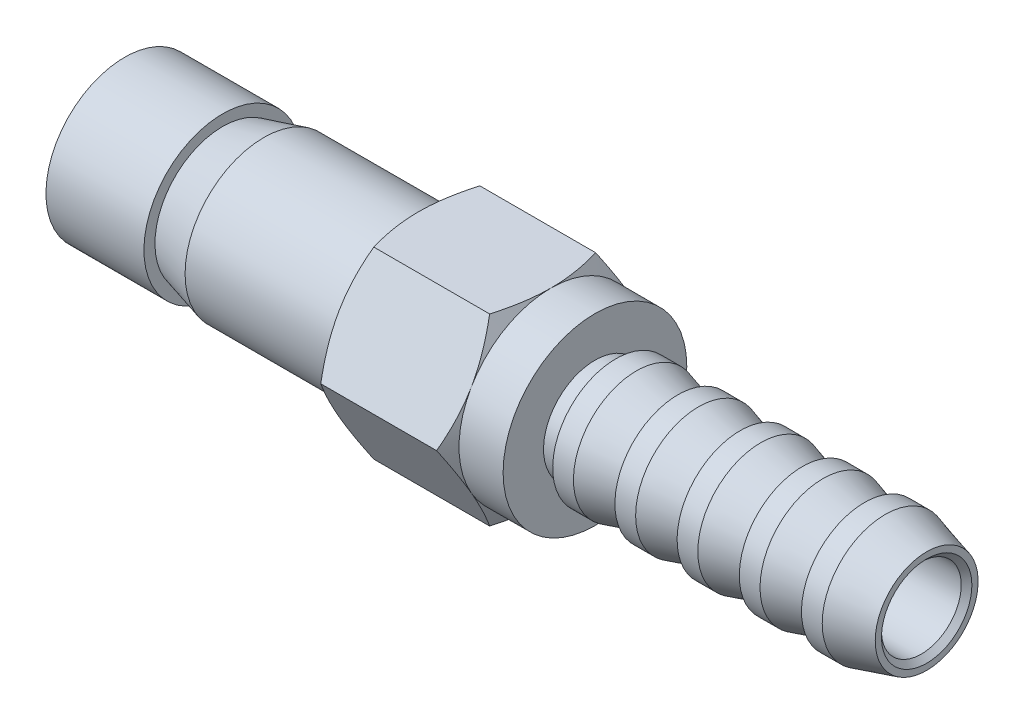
ISO-10303-21;
HEADER;
FILE_DESCRIPTION(('STEP AP214'),'2;1');
FILE_NAME('part.step','',(''),(''),'','','');
FILE_SCHEMA(('AUTOMOTIVE_DESIGN { 1 0 10303 214 1 1 1 1 }'));
ENDSEC;
DATA;
#1=APPLICATION_CONTEXT('core data for automotive mechanical design processes');
#2=APPLICATION_PROTOCOL_DEFINITION('international standard','automotive_design',2000,#1);
#3=PRODUCT_CONTEXT('',#1,'mechanical');
#4=PRODUCT('Part','Part','',(#3));
#5=PRODUCT_RELATED_PRODUCT_CATEGORY('part','',(#4));
#6=PRODUCT_DEFINITION_FORMATION('','',#4);
#7=PRODUCT_DEFINITION_CONTEXT('part definition',#1,'design');
#8=PRODUCT_DEFINITION('design','',#6,#7);
#9=PRODUCT_DEFINITION_SHAPE('','',#8);
#10=(LENGTH_UNIT() NAMED_UNIT(*) SI_UNIT(.MILLI.,.METRE.));
#11=(NAMED_UNIT(*) PLANE_ANGLE_UNIT() SI_UNIT($,.RADIAN.));
#12=(NAMED_UNIT(*) SI_UNIT($,.STERADIAN.) SOLID_ANGLE_UNIT());
#13=UNCERTAINTY_MEASURE_WITH_UNIT(LENGTH_MEASURE(1.E-05),#10,'distance_accuracy_value','');
#14=(GEOMETRIC_REPRESENTATION_CONTEXT(3) GLOBAL_UNCERTAINTY_ASSIGNED_CONTEXT((#13)) GLOBAL_UNIT_ASSIGNED_CONTEXT((#10,
#11,#12)) REPRESENTATION_CONTEXT('',''));
#15=CARTESIAN_POINT('',(0.,0.,0.));
#16=DIRECTION('',(0.,0.,1.));
#17=DIRECTION('',(1.,0.,0.));
#18=AXIS2_PLACEMENT_3D('',#15,#16,#17);
#19=CARTESIAN_POINT('',(33.4644999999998,3.46075000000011,0.));
#20=DIRECTION('',(-1.,0.,0.));
#21=DIRECTION('',(0.,-1.,0.));
#22=AXIS2_PLACEMENT_3D('',#19,#20,#21);
#23=PLANE('',#22);
#24=CARTESIAN_POINT('',(33.4644999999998,1.06115338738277E-13,0.));
#25=DIRECTION('',(-1.,0.,0.));
#26=DIRECTION('',(0.,-1.,0.));
#27=AXIS2_PLACEMENT_3D('',#24,#25,#26);
#28=CIRCLE('',#27,3.81000000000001);
#29=CARTESIAN_POINT('',(33.4644999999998,-3.8099999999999,0.));
#30=VERTEX_POINT('',#29);
#31=EDGE_CURVE('E19',#30,#30,#28,.F.);
#32=ORIENTED_EDGE('',*,*,#31,.F.);
#33=EDGE_LOOP('',(#32));
#34=FACE_BOUND('',#33,.T.);
#35=CARTESIAN_POINT('',(33.4644999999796,1.06092796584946E-13,0.));
#36=DIRECTION('',(-1.,0.,0.));
#37=DIRECTION('',(0.,-1.,0.));
#38=AXIS2_PLACEMENT_3D('',#35,#36,#37);
#39=CIRCLE('',#38,3.11150000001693);
#40=CARTESIAN_POINT('',(33.4644999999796,-3.11150000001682,0.));
#41=VERTEX_POINT('',#40);
#42=EDGE_CURVE('E290',#41,#41,#39,.T.);
#43=ORIENTED_EDGE('',*,*,#42,.F.);
#44=EDGE_LOOP('',(#43));
#45=FACE_BOUND('',#44,.T.);
#46=ADVANCED_FACE('F16',(#34,#45),#23,.T.);
#47=CARTESIAN_POINT('',(34.0915624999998,1.06393810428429E-13,0.));
#48=DIRECTION('',(-1.,0.,0.));
#49=DIRECTION('',(0.,-1.,0.));
#50=AXIS2_PLACEMENT_3D('',#47,#48,#49);
#51=CYLINDRICAL_SURFACE('',#50,3.81000000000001);
#52=ORIENTED_EDGE('',*,*,#31,.T.);
#53=EDGE_LOOP('',(#52));
#54=FACE_BOUND('',#53,.T.);
#55=CARTESIAN_POINT('',(34.7186250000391,1.06672282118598E-13,0.));
#56=DIRECTION('',(-1.,0.,0.));
#57=DIRECTION('',(0.,1.,0.));
#58=AXIS2_PLACEMENT_3D('',#55,#56,#57);
#59=CIRCLE('',#58,3.80999999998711);
#60=CARTESIAN_POINT('',(34.7186250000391,3.80999999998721,0.));
#61=VERTEX_POINT('',#60);
#62=EDGE_CURVE('E292',#61,#61,#59,.F.);
#63=ORIENTED_EDGE('',*,*,#62,.F.);
#64=EDGE_LOOP('',(#63));
#65=FACE_BOUND('',#64,.T.);
#66=ADVANCED_FACE('F300',(#54,#65),#51,.T.);
#67=CARTESIAN_POINT('',(30.9562499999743,1.04950770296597E-13,0.));
#68=DIRECTION('',(-1.,0.,0.));
#69=DIRECTION('',(0.,-1.,0.));
#70=AXIS2_PLACEMENT_3D('',#67,#68,#69);
#71=CONICAL_SURFACE('',#70,3.81000000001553,0.271599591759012);
#72=CARTESIAN_POINT('',(30.9562499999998,1.05001451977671E-13,0.));
#73=DIRECTION('',(-1.,0.,0.));
#74=DIRECTION('',(0.,-1.,0.));
#75=AXIS2_PLACEMENT_3D('',#72,#73,#74);
#76=CIRCLE('',#75,3.81000000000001);
#77=CARTESIAN_POINT('',(30.9562499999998,-3.8099999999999,0.));
#78=VERTEX_POINT('',#77);
#79=EDGE_CURVE('E289',#78,#78,#76,.T.);
#80=ORIENTED_EDGE('',*,*,#79,.F.);
#81=EDGE_LOOP('',(#80));
#82=FACE_BOUND('',#81,.T.);
#83=ORIENTED_EDGE('',*,*,#42,.T.);
#84=EDGE_LOOP('',(#83));
#85=FACE_BOUND('',#84,.T.);
#86=ADVANCED_FACE('F309',(#82,#85),#71,.T.);
#87=CARTESIAN_POINT('',(34.7186250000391,1.06685493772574E-13,0.));
#88=DIRECTION('',(-1.,0.,0.));
#89=DIRECTION('',(0.,0.,1.));
#90=AXIS2_PLACEMENT_3D('',#87,#88,#89);
#91=CONICAL_SURFACE('',#90,3.80999999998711,0.271599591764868);
#92=ORIENTED_EDGE('',*,*,#62,.T.);
#93=EDGE_LOOP('',(#92));
#94=FACE_BOUND('',#93,.T.);
#95=CARTESIAN_POINT('',(37.2268749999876,1.06685493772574E-13,0.));
#96=DIRECTION('',(-1.,0.,0.));
#97=DIRECTION('',(0.,0.,1.));
#98=AXIS2_PLACEMENT_3D('',#95,#96,#97);
#99=CIRCLE('',#98,3.1114999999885);
#100=CARTESIAN_POINT('',(37.2268749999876,1.06685493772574E-13,3.11149999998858));
#101=VERTEX_POINT('',#100);
#102=EDGE_CURVE('E287',#101,#101,#99,.F.);
#103=ORIENTED_EDGE('',*,*,#102,.F.);
#104=EDGE_LOOP('',(#103));
#105=FACE_BOUND('',#104,.T.);
#106=ADVANCED_FACE('F879',(#94,#105),#91,.T.);
#107=CARTESIAN_POINT('',(30.3291874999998,1.04722980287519E-13,0.));
#108=DIRECTION('',(-1.,0.,0.));
#109=DIRECTION('',(0.,-1.,0.));
#110=AXIS2_PLACEMENT_3D('',#107,#108,#109);
#111=CYLINDRICAL_SURFACE('',#110,3.81000000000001);
#112=CARTESIAN_POINT('',(29.7021249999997,1.04444508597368E-13,0.));
#113=DIRECTION('',(-1.,0.,0.));
#114=DIRECTION('',(0.,-1.,0.));
#115=AXIS2_PLACEMENT_3D('',#112,#113,#114);
#116=CIRCLE('',#115,3.81000000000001);
#117=CARTESIAN_POINT('',(29.7021249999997,-3.8099999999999,0.));
#118=VERTEX_POINT('',#117);
#119=EDGE_CURVE('E284',#118,#118,#116,.T.);
#120=ORIENTED_EDGE('',*,*,#119,.F.);
#121=EDGE_LOOP('',(#120));
#122=FACE_BOUND('',#121,.T.);
#123=ORIENTED_EDGE('',*,*,#79,.T.);
#124=EDGE_LOOP('',(#123));
#125=FACE_BOUND('',#124,.T.);
#126=ADVANCED_FACE('F869',(#122,#125),#111,.T.);
#127=CARTESIAN_POINT('',(37.2268749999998,3.46075000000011,0.));
#128=DIRECTION('',(-1.,0.,0.));
#129=DIRECTION('',(0.,-1.,0.));
#130=AXIS2_PLACEMENT_3D('',#127,#128,#129);
#131=PLANE('',#130);
#132=CARTESIAN_POINT('',(37.2268749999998,1.07786168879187E-13,0.));
#133=DIRECTION('',(-1.,0.,0.));
#134=DIRECTION('',(0.,-1.,0.));
#135=AXIS2_PLACEMENT_3D('',#132,#133,#134);
#136=CIRCLE('',#135,3.81000000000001);
#137=CARTESIAN_POINT('',(37.2268749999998,-3.8099999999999,0.));
#138=VERTEX_POINT('',#137);
#139=EDGE_CURVE('E281',#138,#138,#136,.F.);
#140=ORIENTED_EDGE('',*,*,#139,.F.);
#141=EDGE_LOOP('',(#140));
#142=FACE_BOUND('',#141,.T.);
#143=ORIENTED_EDGE('',*,*,#102,.T.);
#144=EDGE_LOOP('',(#143));
#145=FACE_BOUND('',#144,.T.);
#146=ADVANCED_FACE('F859',(#142,#145),#131,.T.);
#147=CARTESIAN_POINT('',(29.7021249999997,3.4607500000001,0.));
#148=DIRECTION('',(-1.,0.,0.));
#149=DIRECTION('',(0.,-1.,0.));
#150=AXIS2_PLACEMENT_3D('',#147,#148,#149);
#151=PLANE('',#150);
#152=ORIENTED_EDGE('',*,*,#119,.T.);
#153=EDGE_LOOP('',(#152));
#154=FACE_BOUND('',#153,.T.);
#155=CARTESIAN_POINT('',(29.7021249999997,1.04444508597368E-13,0.));
#156=DIRECTION('',(-1.,0.,0.));
#157=DIRECTION('',(0.,-1.,0.));
#158=AXIS2_PLACEMENT_3D('',#155,#156,#157);
#159=CIRCLE('',#158,3.11149999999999);
#160=CARTESIAN_POINT('',(29.7021249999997,-3.11149999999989,0.));
#161=VERTEX_POINT('',#160);
#162=EDGE_CURVE('E278',#161,#161,#159,.T.);
#163=ORIENTED_EDGE('',*,*,#162,.F.);
#164=EDGE_LOOP('',(#163));
#165=FACE_BOUND('',#164,.T.);
#166=ADVANCED_FACE('F849',(#154,#165),#151,.T.);
#167=CARTESIAN_POINT('',(37.8539374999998,1.08064640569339E-13,0.));
#168=DIRECTION('',(-1.,0.,0.));
#169=DIRECTION('',(0.,-1.,0.));
#170=AXIS2_PLACEMENT_3D('',#167,#168,#169);
#171=CYLINDRICAL_SURFACE('',#170,3.81000000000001);
#172=ORIENTED_EDGE('',*,*,#139,.T.);
#173=EDGE_LOOP('',(#172));
#174=FACE_BOUND('',#173,.T.);
#175=CARTESIAN_POINT('',(38.4809999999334,1.08343112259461E-13,0.));
#176=DIRECTION('',(-1.,0.,0.));
#177=DIRECTION('',(0.,1.,0.));
#178=AXIS2_PLACEMENT_3D('',#175,#176,#177);
#179=CIRCLE('',#178,3.81000000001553);
#180=CARTESIAN_POINT('',(38.4809999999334,3.81000000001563,0.));
#181=VERTEX_POINT('',#180);
#182=EDGE_CURVE('E277',#181,#181,#179,.F.);
#183=ORIENTED_EDGE('',*,*,#182,.F.);
#184=EDGE_LOOP('',(#183));
#185=FACE_BOUND('',#184,.T.);
#186=ADVANCED_FACE('F839',(#174,#185),#171,.T.);
#187=CARTESIAN_POINT('',(29.0750624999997,1.04166036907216E-13,0.));
#188=DIRECTION('',(-1.,0.,0.));
#189=DIRECTION('',(0.,-1.,0.));
#190=AXIS2_PLACEMENT_3D('',#187,#188,#189);
#191=CYLINDRICAL_SURFACE('',#190,3.11149999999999);
#192=CARTESIAN_POINT('',(28.4479999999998,1.03887565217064E-13,0.));
#193=DIRECTION('',(-1.,0.,0.));
#194=DIRECTION('',(0.,-1.,0.));
#195=AXIS2_PLACEMENT_3D('',#192,#193,#194);
#196=CIRCLE('',#195,3.11149999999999);
#197=CARTESIAN_POINT('',(28.4479999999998,-3.11149999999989,0.));
#198=VERTEX_POINT('',#197);
#199=EDGE_CURVE('E274',#198,#198,#196,.T.);
#200=ORIENTED_EDGE('',*,*,#199,.F.);
#201=EDGE_LOOP('',(#200));
#202=FACE_BOUND('',#201,.T.);
#203=ORIENTED_EDGE('',*,*,#162,.T.);
#204=EDGE_LOOP('',(#203));
#205=FACE_BOUND('',#204,.T.);
#206=ADVANCED_FACE('F829',(#202,#205),#191,.T.);
#207=CARTESIAN_POINT('',(38.4810000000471,1.0842021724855E-13,0.));
#208=DIRECTION('',(-1.,0.,0.));
#209=DIRECTION('',(0.,0.,1.));
#210=AXIS2_PLACEMENT_3D('',#207,#208,#209);
#211=CONICAL_SURFACE('',#210,3.80999999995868,0.271599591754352);
#212=ORIENTED_EDGE('',*,*,#182,.T.);
#213=EDGE_LOOP('',(#212));
#214=FACE_BOUND('',#213,.T.);
#215=CARTESIAN_POINT('',(40.9892499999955,1.0842021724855E-13,0.));
#216=DIRECTION('',(-1.,0.,0.));
#217=DIRECTION('',(0.,0.,1.));
#218=AXIS2_PLACEMENT_3D('',#215,#216,#217);
#219=CIRCLE('',#218,3.1114999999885);
#220=CARTESIAN_POINT('',(40.9892499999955,1.0842021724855E-13,3.11149999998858));
#221=VERTEX_POINT('',#220);
#222=EDGE_CURVE('E271',#221,#221,#219,.F.);
#223=ORIENTED_EDGE('',*,*,#222,.F.);
#224=EDGE_LOOP('',(#223));
#225=FACE_BOUND('',#224,.T.);
#226=ADVANCED_FACE('F819',(#214,#225),#211,.T.);
#227=CARTESIAN_POINT('',(28.4479999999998,4.3338750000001,0.));
#228=DIRECTION('',(1.,0.,0.));
#229=DIRECTION('',(0.,0.,-1.));
#230=AXIS2_PLACEMENT_3D('',#227,#228,#229);
#231=PLANE('',#230);
#232=ORIENTED_EDGE('',*,*,#199,.T.);
#233=EDGE_LOOP('',(#232));
#234=FACE_BOUND('',#233,.T.);
#235=CARTESIAN_POINT('',(28.4479999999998,1.03887565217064E-13,0.));
#236=DIRECTION('',(-1.,0.,0.));
#237=DIRECTION('',(0.,-1.,0.));
#238=AXIS2_PLACEMENT_3D('',#235,#236,#237);
#239=CIRCLE('',#238,5.55625);
#240=CARTESIAN_POINT('',(28.4479999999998,-5.5562499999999,0.));
#241=VERTEX_POINT('',#240);
#242=EDGE_CURVE('E268',#241,#241,#239,.T.);
#243=ORIENTED_EDGE('',*,*,#242,.F.);
#244=EDGE_LOOP('',(#243));
#245=FACE_BOUND('',#244,.T.);
#246=ADVANCED_FACE('F809',(#234,#245),#231,.T.);
#247=CARTESIAN_POINT('',(40.9892499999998,3.46075000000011,0.));
#248=DIRECTION('',(-1.,0.,0.));
#249=DIRECTION('',(0.,-1.,0.));
#250=AXIS2_PLACEMENT_3D('',#247,#248,#249);
#251=PLANE('',#250);
#252=CARTESIAN_POINT('',(40.9892499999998,1.09456999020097E-13,0.));
#253=DIRECTION('',(-1.,0.,0.));
#254=DIRECTION('',(0.,-1.,0.));
#255=AXIS2_PLACEMENT_3D('',#252,#253,#254);
#256=CIRCLE('',#255,3.81000000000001);
#257=CARTESIAN_POINT('',(40.9892499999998,-3.8099999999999,0.));
#258=VERTEX_POINT('',#257);
#259=EDGE_CURVE('E264',#258,#258,#256,.F.);
#260=ORIENTED_EDGE('',*,*,#259,.F.);
#261=EDGE_LOOP('',(#260));
#262=FACE_BOUND('',#261,.T.);
#263=ORIENTED_EDGE('',*,*,#222,.T.);
#264=EDGE_LOOP('',(#263));
#265=FACE_BOUND('',#264,.T.);
#266=ADVANCED_FACE('F800',(#262,#265),#251,.T.);
#267=CARTESIAN_POINT('',(23.1139999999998,1.01518793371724E-13,0.));
#268=DIRECTION('',(-1.,0.,0.));
#269=DIRECTION('',(0.,-1.,0.));
#270=AXIS2_PLACEMENT_3D('',#267,#268,#269);
#271=CYLINDRICAL_SURFACE('',#270,5.55625);
#272=ORIENTED_EDGE('',*,*,#242,.T.);
#273=EDGE_LOOP('',(#272));
#274=FACE_BOUND('',#273,.T.);
#275=CARTESIAN_POINT('',(25.7810000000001,-1.14575238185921E-13,0.));
#276=DIRECTION('',(-1.,0.,0.));
#277=DIRECTION('',(0.,0.,-1.));
#278=AXIS2_PLACEMENT_3D('',#275,#276,#277);
#279=CIRCLE('',#278,5.55624999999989);
#280=CARTESIAN_POINT('',(25.7810000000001,-2.77812500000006,-4.81185364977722));
#281=VERTEX_POINT('',#280);
#282=CARTESIAN_POINT('',(25.781,2.77812499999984,-4.81185364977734));
#283=VERTEX_POINT('',#282);
#284=EDGE_CURVE('E267',#281,#283,#279,.F.);
#285=ORIENTED_EDGE('',*,*,#284,.T.);
#286=CARTESIAN_POINT('',(25.781,-1.14575238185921E-13,0.));
#287=DIRECTION('',(-1.,0.,0.));
#288=DIRECTION('',(0.,0.,-1.));
#289=AXIS2_PLACEMENT_3D('',#286,#287,#288);
#290=CIRCLE('',#289,5.55625000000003);
#291=CARTESIAN_POINT('',(25.7809999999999,5.55625000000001,0.));
#292=VERTEX_POINT('',#291);
#293=EDGE_CURVE('E109',#283,#292,#290,.F.);
#294=ORIENTED_EDGE('',*,*,#293,.T.);
#295=CARTESIAN_POINT('',(25.7809999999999,-1.14575238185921E-13,0.));
#296=DIRECTION('',(-1.,0.,0.));
#297=DIRECTION('',(0.,0.,-1.));
#298=AXIS2_PLACEMENT_3D('',#295,#296,#297);
#299=CIRCLE('',#298,5.55625000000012);
#300=CARTESIAN_POINT('',(25.7809999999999,2.77812499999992,4.81185364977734));
#301=VERTEX_POINT('',#300);
#302=EDGE_CURVE('E449',#292,#301,#299,.F.);
#303=ORIENTED_EDGE('',*,*,#302,.T.);
#304=CARTESIAN_POINT('',(25.781,-1.14575238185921E-13,0.));
#305=DIRECTION('',(-1.,0.,0.));
#306=DIRECTION('',(0.,0.,-1.));
#307=AXIS2_PLACEMENT_3D('',#304,#305,#306);
#308=CIRCLE('',#307,5.55625000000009);
#309=CARTESIAN_POINT('',(25.781,-2.77812500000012,4.81185364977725));
#310=VERTEX_POINT('',#309);
#311=EDGE_CURVE('E451',#301,#310,#308,.F.);
#312=ORIENTED_EDGE('',*,*,#311,.T.);
#313=CARTESIAN_POINT('',(25.781,-1.14575238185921E-13,0.));
#314=DIRECTION('',(-1.,0.,0.));
#315=DIRECTION('',(0.,0.,-1.));
#316=AXIS2_PLACEMENT_3D('',#313,#314,#315);
#317=CIRCLE('',#316,5.55624999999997);
#318=CARTESIAN_POINT('',(25.7810000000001,-5.55624999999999,0.));
#319=VERTEX_POINT('',#318);
#320=EDGE_CURVE('E453',#310,#319,#317,.F.);
#321=ORIENTED_EDGE('',*,*,#320,.T.);
#322=CARTESIAN_POINT('',(25.7810000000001,-1.14575238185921E-13,0.));
#323=DIRECTION('',(-1.,0.,0.));
#324=DIRECTION('',(0.,0.,-1.));
#325=AXIS2_PLACEMENT_3D('',#322,#323,#324);
#326=CIRCLE('',#325,5.55624999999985);
#327=EDGE_CURVE('E455',#319,#281,#326,.F.);
#328=ORIENTED_EDGE('',*,*,#327,.T.);
#329=EDGE_LOOP('',(#285,#294,#303,#312,#321,#328));
#330=FACE_BOUND('',#329,.T.);
#331=ADVANCED_FACE('F791',(#274,#330),#271,.T.);
#332=CARTESIAN_POINT('',(41.6163124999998,1.09735470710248E-13,0.));
#333=DIRECTION('',(-1.,0.,0.));
#334=DIRECTION('',(0.,-1.,0.));
#335=AXIS2_PLACEMENT_3D('',#332,#333,#334);
#336=CYLINDRICAL_SURFACE('',#335,3.81000000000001);
#337=ORIENTED_EDGE('',*,*,#259,.T.);
#338=EDGE_LOOP('',(#337));
#339=FACE_BOUND('',#338,.T.);
#340=CARTESIAN_POINT('',(42.2433749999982,1.10013942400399E-13,0.));
#341=DIRECTION('',(-1.,0.,0.));
#342=DIRECTION('',(0.,1.,0.));
#343=AXIS2_PLACEMENT_3D('',#340,#341,#342);
#344=CIRCLE('',#343,3.8099999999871);
#345=CARTESIAN_POINT('',(42.2433749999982,3.80999999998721,0.));
#346=VERTEX_POINT('',#345);
#347=EDGE_CURVE('E113',#346,#346,#344,.F.);
#348=ORIENTED_EDGE('',*,*,#347,.F.);
#349=EDGE_LOOP('',(#348));
#350=FACE_BOUND('',#349,.T.);
#351=ADVANCED_FACE('F252',(#339,#350),#336,.T.);
#352=CARTESIAN_POINT('',(25.7810000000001,-1.14575238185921E-13,0.));
#353=DIRECTION('',(-1.,0.,0.));
#354=DIRECTION('',(0.,-1.,0.));
#355=AXIS2_PLACEMENT_3D('',#352,#353,#354);
#356=CONICAL_SURFACE('',#355,5.55624999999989,1.04719755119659);
#357=ORIENTED_EDGE('',*,*,#284,.F.);
#358=CARTESIAN_POINT('',(25.2847357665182,0.,-6.41580486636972));
#359=CARTESIAN_POINT('',(25.3601340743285,-0.22613819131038,-6.2852439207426));
#360=CARTESIAN_POINT('',(25.4292120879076,-0.454087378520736,-6.15363739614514));
#361=CARTESIAN_POINT('',(25.5510299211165,-0.911995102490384,-5.88926424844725));
#362=CARTESIAN_POINT('',(25.6038505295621,-1.14193766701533,-5.75650684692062));
#363=CARTESIAN_POINT('',(25.6687052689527,-1.48902161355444,-5.55611783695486));
#364=CARTESIAN_POINT('',(25.6879353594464,-1.60515470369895,-5.48906836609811));
#365=CARTESIAN_POINT('',(25.7212230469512,-1.83797686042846,-5.35464843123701));
#366=CARTESIAN_POINT('',(25.7352807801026,-1.95466591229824,-5.28727797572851));
#367=CARTESIAN_POINT('',(25.757976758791,-2.18903161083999,-5.15196687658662));
#368=CARTESIAN_POINT('',(25.766587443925,-2.30671027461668,-5.08402506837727));
#369=CARTESIAN_POINT('',(25.7781109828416,-2.54229903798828,-4.94800783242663));
#370=CARTESIAN_POINT('',(25.7810227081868,-2.66020917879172,-4.87993238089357));
#371=CARTESIAN_POINT('',(25.7810000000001,-2.77812500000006,-4.81185364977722));
#372=B_SPLINE_CURVE_WITH_KNOTS('',3,(#358,#359,#360,#361,#362,#363,#364,#365,#366,#367,#368,
#369,#370,#371),.UNSPECIFIED.,.F.,.F.,(4,2,2,2,2,2,4),(0.,0.815698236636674,1.62727497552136,
2.03359582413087,2.43990597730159,2.84825583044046,3.25668653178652),.UNSPECIFIED.);
#373=CARTESIAN_POINT('',(25.2847357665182,0.,-6.41580486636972));
#374=VERTEX_POINT('',#373);
#375=EDGE_CURVE('E228',#374,#281,#372,.T.);
#376=ORIENTED_EDGE('',*,*,#375,.F.);
#377=CARTESIAN_POINT('',(25.781,2.77812499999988,-4.81185364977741));
#378=CARTESIAN_POINT('',(25.7810227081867,2.66020917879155,-4.87993238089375));
#379=CARTESIAN_POINT('',(25.7781109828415,2.54229903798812,-4.9480078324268));
#380=CARTESIAN_POINT('',(25.7665874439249,2.30671027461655,-5.08402506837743));
#381=CARTESIAN_POINT('',(25.7579767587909,2.18903161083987,-5.15196687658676));
#382=CARTESIAN_POINT('',(25.7352807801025,1.95466591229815,-5.28727797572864));
#383=CARTESIAN_POINT('',(25.7212230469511,1.83797686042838,-5.35464843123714));
#384=CARTESIAN_POINT('',(25.6879353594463,1.60515470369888,-5.48906836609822));
#385=CARTESIAN_POINT('',(25.6687052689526,1.48902161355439,-5.55611783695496));
#386=CARTESIAN_POINT('',(25.603850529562,1.14193766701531,-5.75650684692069));
#387=CARTESIAN_POINT('',(25.5510299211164,0.911995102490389,-5.88926424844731));
#388=CARTESIAN_POINT('',(25.4292120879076,0.454087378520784,-6.15363739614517));
#389=CARTESIAN_POINT('',(25.3601340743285,0.226138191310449,-6.28524392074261));
#390=CARTESIAN_POINT('',(25.2847357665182,0.,-6.41580486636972));
#391=B_SPLINE_CURVE_WITH_KNOTS('',3,(#377,#378,#379,#380,#381,#382,#383,#384,#385,#386,#387,
#388,#389,#390),.UNSPECIFIED.,.F.,.F.,(4,2,2,2,2,2,4),(0.,0.408430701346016,0.816780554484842,
1.22309070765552,1.62941155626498,2.44098829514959,3.25668653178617),.UNSPECIFIED.);
#392=EDGE_CURVE('E112',#283,#374,#391,.T.);
#393=ORIENTED_EDGE('',*,*,#392,.F.);
#394=EDGE_LOOP('',(#357,#376,#393));
#395=FACE_BOUND('',#394,.T.);
#396=ADVANCED_FACE('F244',(#395),#356,.T.);
#397=CARTESIAN_POINT('',(25.7810000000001,-1.14575238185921E-13,0.));
#398=DIRECTION('',(-1.,0.,0.));
#399=DIRECTION('',(0.,-1.,0.));
#400=AXIS2_PLACEMENT_3D('',#397,#398,#399);
#401=CONICAL_SURFACE('',#400,5.55624999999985,1.0471975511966);
#402=ORIENTED_EDGE('',*,*,#327,.F.);
#403=CARTESIAN_POINT('',(25.2847357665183,-5.55624999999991,-3.20790243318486));
#404=CARTESIAN_POINT('',(25.3601340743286,-5.55624999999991,-2.94678054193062));
#405=CARTESIAN_POINT('',(25.4292120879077,-5.55624999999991,-2.68356749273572));
#406=CARTESIAN_POINT('',(25.5510299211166,-5.55624999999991,-2.15482119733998));
#407=CARTESIAN_POINT('',(25.6038505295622,-5.55624999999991,-1.88930639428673));
#408=CARTESIAN_POINT('',(25.6687052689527,-5.55624999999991,-1.48852837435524));
#409=CARTESIAN_POINT('',(25.6879353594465,-5.55624999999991,-1.35442943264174));
#410=CARTESIAN_POINT('',(25.7212230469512,-5.55624999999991,-1.08558956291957));
#411=CARTESIAN_POINT('',(25.7352807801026,-5.55624999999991,-0.950848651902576));
#412=CARTESIAN_POINT('',(25.757976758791,-5.55624999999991,-0.6802264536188));
#413=CARTESIAN_POINT('',(25.766587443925,-5.55624999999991,-0.544342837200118));
#414=CARTESIAN_POINT('',(25.7781109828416,-5.55624999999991,-0.272308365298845));
#415=CARTESIAN_POINT('',(25.7810227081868,-5.55624999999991,-0.136157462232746));
#416=CARTESIAN_POINT('',(25.7810000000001,-5.55624999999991,0.));
#417=B_SPLINE_CURVE_WITH_KNOTS('',3,(#403,#404,#405,#406,#407,#408,#409,#410,#411,#412,#413,
#414,#415,#416),.UNSPECIFIED.,.F.,.F.,(4,2,2,2,2,2,4),(0.,0.815698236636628,1.62727497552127,
2.03359582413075,2.43990597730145,2.8482558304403,3.25668653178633),.UNSPECIFIED.);
#418=CARTESIAN_POINT('',(25.2847357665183,-5.55624999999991,-3.20790243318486));
#419=VERTEX_POINT('',#418);
#420=EDGE_CURVE('E229',#419,#319,#417,.T.);
#421=ORIENTED_EDGE('',*,*,#420,.F.);
#422=CARTESIAN_POINT('',(25.7810000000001,-2.77812500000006,-4.81185364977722));
#423=CARTESIAN_POINT('',(25.7810227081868,-2.89604082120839,-4.74377491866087));
#424=CARTESIAN_POINT('',(25.7781109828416,-3.01395096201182,-4.67569946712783));
#425=CARTESIAN_POINT('',(25.766587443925,-3.2495397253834,-4.53968223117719));
#426=CARTESIAN_POINT('',(25.757976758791,-3.36721838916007,-4.47174042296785));
#427=CARTESIAN_POINT('',(25.7352807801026,-3.6015840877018,-4.33642932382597));
#428=CARTESIAN_POINT('',(25.7212230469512,-3.71827313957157,-4.26905886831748));
#429=CARTESIAN_POINT('',(25.6879353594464,-3.95109529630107,-4.13463893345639));
#430=CARTESIAN_POINT('',(25.6687052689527,-4.06722838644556,-4.06758946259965));
#431=CARTESIAN_POINT('',(25.6038505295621,-4.41431233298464,-3.86720045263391));
#432=CARTESIAN_POINT('',(25.5510299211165,-4.64425489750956,-3.73444305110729));
#433=CARTESIAN_POINT('',(25.4292120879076,-5.10216262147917,-3.47006990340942));
#434=CARTESIAN_POINT('',(25.3601340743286,-5.33011180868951,-3.33846337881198));
#435=CARTESIAN_POINT('',(25.2847357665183,-5.55624999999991,-3.20790243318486));
#436=B_SPLINE_CURVE_WITH_KNOTS('',3,(#422,#423,#424,#425,#426,#427,#428,#429,#430,#431,#432,
#433,#434,#435),.UNSPECIFIED.,.F.,.F.,(4,2,2,2,2,2,4),(0.,0.408430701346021,0.81678055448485,
1.22309070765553,1.629411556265,2.44098829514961,3.25668653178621),.UNSPECIFIED.);
#437=EDGE_CURVE('E221',#281,#419,#436,.T.);
#438=ORIENTED_EDGE('',*,*,#437,.F.);
#439=EDGE_LOOP('',(#402,#421,#438));
#440=FACE_BOUND('',#439,.T.);
#441=ADVANCED_FACE('F239',(#440),#401,.T.);
#442=CARTESIAN_POINT('',(25.7810000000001,-1.14575238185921E-13,0.));
#443=DIRECTION('',(-1.,0.,0.));
#444=DIRECTION('',(0.,-1.,0.));
#445=AXIS2_PLACEMENT_3D('',#442,#443,#444);
#446=CONICAL_SURFACE('',#445,5.55624999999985,1.0471975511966);
#447=ORIENTED_EDGE('',*,*,#320,.F.);
#448=CARTESIAN_POINT('',(25.2847357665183,-5.55624999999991,3.20790243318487));
#449=CARTESIAN_POINT('',(25.3601340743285,-5.33011180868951,3.33846337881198));
#450=CARTESIAN_POINT('',(25.4292120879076,-5.10216262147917,3.47006990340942));
#451=CARTESIAN_POINT('',(25.5510299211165,-4.64425489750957,3.73444305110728));
#452=CARTESIAN_POINT('',(25.6038505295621,-4.41431233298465,3.8672004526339));
#453=CARTESIAN_POINT('',(25.6687052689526,-4.06722838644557,4.06758946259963));
#454=CARTESIAN_POINT('',(25.6879353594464,-3.95109529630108,4.13463893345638));
#455=CARTESIAN_POINT('',(25.7212230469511,-3.71827313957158,4.26905886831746));
#456=CARTESIAN_POINT('',(25.7352807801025,-3.60158408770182,4.33642932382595));
#457=CARTESIAN_POINT('',(25.757976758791,-3.36721838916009,4.47174042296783));
#458=CARTESIAN_POINT('',(25.7665874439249,-3.24953972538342,4.53968223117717));
#459=CARTESIAN_POINT('',(25.7781109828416,-3.01395096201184,4.6756994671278));
#460=CARTESIAN_POINT('',(25.7810227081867,-2.89604082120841,4.74377491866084));
#461=CARTESIAN_POINT('',(25.781,-2.77812500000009,4.81185364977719));
#462=B_SPLINE_CURVE_WITH_KNOTS('',3,(#448,#449,#450,#451,#452,#453,#454,#455,#456,#457,#458,
#459,#460,#461),.UNSPECIFIED.,.F.,.F.,(4,2,2,2,2,2,4),(0.,0.815698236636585,1.62727497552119,
2.03359582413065,2.43990597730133,2.84825583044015,3.25668653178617),.UNSPECIFIED.);
#463=CARTESIAN_POINT('',(25.2847357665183,-5.55624999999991,3.20790243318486));
#464=VERTEX_POINT('',#463);
#465=EDGE_CURVE('E411',#464,#310,#462,.T.);
#466=ORIENTED_EDGE('',*,*,#465,.F.);
#467=CARTESIAN_POINT('',(25.7810000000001,-5.55624999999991,0.));
#468=CARTESIAN_POINT('',(25.7810227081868,-5.55624999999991,0.136157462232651));
#469=CARTESIAN_POINT('',(25.7781109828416,-5.55624999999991,0.272308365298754));
#470=CARTESIAN_POINT('',(25.766587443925,-5.55624999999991,0.544342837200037));
#471=CARTESIAN_POINT('',(25.757976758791,-5.55624999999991,0.680226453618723));
#472=CARTESIAN_POINT('',(25.7352807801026,-5.55624999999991,0.950848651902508));
#473=CARTESIAN_POINT('',(25.7212230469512,-5.55624999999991,1.0855895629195));
#474=CARTESIAN_POINT('',(25.6879353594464,-5.55624999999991,1.35442943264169));
#475=CARTESIAN_POINT('',(25.6687052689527,-5.55624999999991,1.48852837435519));
#476=CARTESIAN_POINT('',(25.6038505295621,-5.55624999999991,1.88930639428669));
#477=CARTESIAN_POINT('',(25.5510299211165,-5.55624999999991,2.15482119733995));
#478=CARTESIAN_POINT('',(25.4292120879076,-5.55624999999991,2.68356749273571));
#479=CARTESIAN_POINT('',(25.3601340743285,-5.55624999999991,2.94678054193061));
#480=CARTESIAN_POINT('',(25.2847357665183,-5.55624999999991,3.20790243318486));
#481=B_SPLINE_CURVE_WITH_KNOTS('',3,(#467,#468,#469,#470,#471,#472,#473,#474,#475,#476,#477,
#478,#479,#480),.UNSPECIFIED.,.F.,.F.,(4,2,2,2,2,2,4),(0.,0.40843070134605,0.81678055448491,
1.22309070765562,1.62941155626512,2.44098829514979,3.25668653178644),.UNSPECIFIED.);
#482=EDGE_CURVE('E443',#319,#464,#481,.T.);
#483=ORIENTED_EDGE('',*,*,#482,.F.);
#484=EDGE_LOOP('',(#447,#466,#483));
#485=FACE_BOUND('',#484,.T.);
#486=ADVANCED_FACE('F243',(#485),#446,.T.);
#487=CARTESIAN_POINT('',(25.781,-1.14575238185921E-13,0.));
#488=DIRECTION('',(-1.,0.,0.));
#489=DIRECTION('',(0.,0.,1.));
#490=AXIS2_PLACEMENT_3D('',#487,#488,#489);
#491=CONICAL_SURFACE('',#490,5.55624999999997,1.0471975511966);
#492=CARTESIAN_POINT('',(25.781,-2.77812500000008,4.81185364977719));
#493=CARTESIAN_POINT('',(25.7810227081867,-2.66020917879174,4.87993238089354));
#494=CARTESIAN_POINT('',(25.7781109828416,-2.5422990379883,4.94800783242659));
#495=CARTESIAN_POINT('',(25.7665874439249,-2.30671027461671,5.08402506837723));
#496=CARTESIAN_POINT('',(25.757976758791,-2.18903161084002,5.15196687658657));
#497=CARTESIAN_POINT('',(25.7352807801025,-1.95466591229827,5.28727797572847));
#498=CARTESIAN_POINT('',(25.7212230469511,-1.8379768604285,5.35464843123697));
#499=CARTESIAN_POINT('',(25.6879353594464,-1.60515470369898,5.48906836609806));
#500=CARTESIAN_POINT('',(25.6687052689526,-1.48902161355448,5.55611783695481));
#501=CARTESIAN_POINT('',(25.6038505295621,-1.14193766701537,5.75650684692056));
#502=CARTESIAN_POINT('',(25.5510299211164,-0.911995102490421,5.88926424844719));
#503=CARTESIAN_POINT('',(25.4292120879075,-0.454087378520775,6.15363739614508));
#504=CARTESIAN_POINT('',(25.3601340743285,-0.22613819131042,6.28524392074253));
#505=CARTESIAN_POINT('',(25.2847357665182,0.,6.41580486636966));
#506=B_SPLINE_CURVE_WITH_KNOTS('',3,(#492,#493,#494,#495,#496,#497,#498,#499,#500,#501,#502,
#503,#504,#505),.UNSPECIFIED.,.F.,.F.,(4,2,2,2,2,2,4),(0.,0.408430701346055,0.81678055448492,
1.22309070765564,1.62941155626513,2.44098829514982,3.25668653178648),.UNSPECIFIED.);
#507=CARTESIAN_POINT('',(25.2847357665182,0.,6.41580486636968));
#508=VERTEX_POINT('',#507);
#509=EDGE_CURVE('E405',#310,#508,#506,.T.);
#510=ORIENTED_EDGE('',*,*,#509,.F.);
#511=ORIENTED_EDGE('',*,*,#311,.F.);
#512=CARTESIAN_POINT('',(25.2847357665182,0.,6.41580486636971));
#513=CARTESIAN_POINT('',(25.3601340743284,0.226138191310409,6.28524392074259));
#514=CARTESIAN_POINT('',(25.4292120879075,0.454087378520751,6.15363739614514));
#515=CARTESIAN_POINT('',(25.5510299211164,0.911995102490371,5.88926424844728));
#516=CARTESIAN_POINT('',(25.603850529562,1.1419376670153,5.75650684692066));
#517=CARTESIAN_POINT('',(25.6687052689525,1.48902161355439,5.55611783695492));
#518=CARTESIAN_POINT('',(25.6879353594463,1.60515470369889,5.48906836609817));
#519=CARTESIAN_POINT('',(25.721223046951,1.83797686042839,5.35464843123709));
#520=CARTESIAN_POINT('',(25.7352807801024,1.95466591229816,5.28727797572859));
#521=CARTESIAN_POINT('',(25.7579767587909,2.1890316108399,5.15196687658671));
#522=CARTESIAN_POINT('',(25.7665874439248,2.30671027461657,5.08402506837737));
#523=CARTESIAN_POINT('',(25.7781109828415,2.54229903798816,4.94800783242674));
#524=CARTESIAN_POINT('',(25.7810227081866,2.66020917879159,4.87993238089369));
#525=CARTESIAN_POINT('',(25.7809999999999,2.77812499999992,4.81185364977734));
#526=B_SPLINE_CURVE_WITH_KNOTS('',3,(#512,#513,#514,#515,#516,#517,#518,#519,#520,#521,#522,
#523,#524,#525),.UNSPECIFIED.,.F.,.F.,(4,2,2,2,2,2,4),(0.,0.815698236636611,1.62727497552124,
2.03359582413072,2.43990597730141,2.84825583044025,3.25668653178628),.UNSPECIFIED.);
#527=EDGE_CURVE('E412',#508,#301,#526,.T.);
#528=ORIENTED_EDGE('',*,*,#527,.F.);
#529=EDGE_LOOP('',(#510,#511,#528));
#530=FACE_BOUND('',#529,.T.);
#531=ADVANCED_FACE('F419',(#530),#491,.T.);
#532=CARTESIAN_POINT('',(25.781,-1.14575238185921E-13,0.));
#533=DIRECTION('',(-1.,0.,0.));
#534=DIRECTION('',(0.,-1.,0.));
#535=AXIS2_PLACEMENT_3D('',#532,#533,#534);
#536=CONICAL_SURFACE('',#535,5.55625000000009,1.0471975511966);
#537=CARTESIAN_POINT('',(25.7809999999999,2.77812499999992,4.81185364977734));
#538=CARTESIAN_POINT('',(25.7810227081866,2.89604082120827,4.74377491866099));
#539=CARTESIAN_POINT('',(25.7781109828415,3.01395096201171,4.67569946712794));
#540=CARTESIAN_POINT('',(25.7665874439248,3.24953972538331,4.5396822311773));
#541=CARTESIAN_POINT('',(25.7579767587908,3.36721838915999,4.47174042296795));
#542=CARTESIAN_POINT('',(25.7352807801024,3.60158408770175,4.33642932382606));
#543=CARTESIAN_POINT('',(25.721223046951,3.71827313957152,4.26905886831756));
#544=CARTESIAN_POINT('',(25.6879353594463,3.95109529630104,4.13463893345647));
#545=CARTESIAN_POINT('',(25.6687052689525,4.06722838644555,4.06758946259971));
#546=CARTESIAN_POINT('',(25.603850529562,4.41431233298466,3.86720045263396));
#547=CARTESIAN_POINT('',(25.5510299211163,4.64425489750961,3.73444305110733));
#548=CARTESIAN_POINT('',(25.4292120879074,5.10216262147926,3.47006990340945));
#549=CARTESIAN_POINT('',(25.3601340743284,5.33011180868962,3.33846337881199));
#550=CARTESIAN_POINT('',(25.2847357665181,5.55625000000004,3.20790243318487));
#551=B_SPLINE_CURVE_WITH_KNOTS('',3,(#537,#538,#539,#540,#541,#542,#543,#544,#545,#546,#547,
#548,#549,#550),.UNSPECIFIED.,.F.,.F.,(4,2,2,2,2,2,4),(0.,0.408430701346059,0.816780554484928,
1.22309070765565,1.62941155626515,2.44098829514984,3.25668653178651),.UNSPECIFIED.);
#552=CARTESIAN_POINT('',(25.2847357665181,5.55625000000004,3.20790243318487));
#553=VERTEX_POINT('',#552);
#554=EDGE_CURVE('E429',#301,#553,#551,.T.);
#555=ORIENTED_EDGE('',*,*,#554,.F.);
#556=ORIENTED_EDGE('',*,*,#302,.F.);
#557=CARTESIAN_POINT('',(25.2847357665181,5.55625000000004,3.20790243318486));
#558=CARTESIAN_POINT('',(25.3601340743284,5.55625000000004,2.94678054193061));
#559=CARTESIAN_POINT('',(25.4292120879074,5.55625000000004,2.6835674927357));
#560=CARTESIAN_POINT('',(25.5510299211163,5.55625000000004,2.15482119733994));
#561=CARTESIAN_POINT('',(25.6038505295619,5.55625000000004,1.88930639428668));
#562=CARTESIAN_POINT('',(25.6687052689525,5.55625000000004,1.48852837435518));
#563=CARTESIAN_POINT('',(25.6879353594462,5.55625000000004,1.35442943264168));
#564=CARTESIAN_POINT('',(25.721223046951,5.55625000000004,1.08558956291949));
#565=CARTESIAN_POINT('',(25.7352807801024,5.55625000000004,0.950848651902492));
#566=CARTESIAN_POINT('',(25.7579767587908,5.55625000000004,0.680226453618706));
#567=CARTESIAN_POINT('',(25.7665874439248,5.55625000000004,0.544342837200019));
#568=CARTESIAN_POINT('',(25.7781109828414,5.55625000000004,0.272308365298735));
#569=CARTESIAN_POINT('',(25.7810227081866,5.55625000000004,0.136157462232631));
#570=CARTESIAN_POINT('',(25.7809999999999,5.55625000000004,0.));
#571=B_SPLINE_CURVE_WITH_KNOTS('',3,(#557,#558,#559,#560,#561,#562,#563,#564,#565,#566,#567,
#568,#569,#570),.UNSPECIFIED.,.F.,.F.,(4,2,2,2,2,2,4),(0.,0.815698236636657,1.62727497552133,
2.03359582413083,2.43990597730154,2.8482558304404,3.25668653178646),.UNSPECIFIED.);
#572=EDGE_CURVE('E127',#553,#292,#571,.T.);
#573=ORIENTED_EDGE('',*,*,#572,.F.);
#574=EDGE_LOOP('',(#555,#556,#573));
#575=FACE_BOUND('',#574,.T.);
#576=ADVANCED_FACE('F422',(#575),#536,.T.);
#577=CARTESIAN_POINT('',(25.781,-1.14575238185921E-13,0.));
#578=DIRECTION('',(-1.,0.,0.));
#579=DIRECTION('',(0.,-1.,0.));
#580=AXIS2_PLACEMENT_3D('',#577,#578,#579);
#581=CONICAL_SURFACE('',#580,5.55625000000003,1.0471975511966);
#582=CARTESIAN_POINT('',(25.7809999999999,5.55625000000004,0.));
#583=CARTESIAN_POINT('',(25.7810227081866,5.55625000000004,-0.136157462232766));
#584=CARTESIAN_POINT('',(25.7781109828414,5.55625000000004,-0.272308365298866));
#585=CARTESIAN_POINT('',(25.7665874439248,5.55625000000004,-0.544342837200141));
#586=CARTESIAN_POINT('',(25.7579767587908,5.55625000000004,-0.680226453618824));
#587=CARTESIAN_POINT('',(25.7352807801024,5.55625000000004,-0.950848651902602));
#588=CARTESIAN_POINT('',(25.721223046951,5.55625000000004,-1.08558956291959));
#589=CARTESIAN_POINT('',(25.6879353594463,5.55625000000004,-1.35442943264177));
#590=CARTESIAN_POINT('',(25.6687052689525,5.55625000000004,-1.48852837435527));
#591=CARTESIAN_POINT('',(25.6038505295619,5.55625000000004,-1.88930639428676));
#592=CARTESIAN_POINT('',(25.5510299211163,5.55625000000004,-2.15482119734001));
#593=CARTESIAN_POINT('',(25.4292120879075,5.55625000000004,-2.68356749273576));
#594=CARTESIAN_POINT('',(25.3601340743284,5.55625000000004,-2.94678054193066));
#595=CARTESIAN_POINT('',(25.2847357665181,5.55625000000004,-3.20790243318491));
#596=B_SPLINE_CURVE_WITH_KNOTS('',3,(#582,#583,#584,#585,#586,#587,#588,#589,#590,#591,#592,
#593,#594,#595),.UNSPECIFIED.,.F.,.F.,(4,2,2,2,2,2,4),(0.,0.408430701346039,0.816780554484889,
1.22309070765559,1.62941155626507,2.44098829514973,3.25668653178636),.UNSPECIFIED.);
#597=CARTESIAN_POINT('',(25.2847357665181,5.55625000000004,-3.20790243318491));
#598=VERTEX_POINT('',#597);
#599=EDGE_CURVE('E107',#292,#598,#596,.T.);
#600=ORIENTED_EDGE('',*,*,#599,.F.);
#601=ORIENTED_EDGE('',*,*,#293,.F.);
#602=CARTESIAN_POINT('',(25.2847357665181,5.55625000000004,-3.20790243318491));
#603=CARTESIAN_POINT('',(25.3601340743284,5.33011180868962,-3.33846337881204));
#604=CARTESIAN_POINT('',(25.4292120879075,5.10216262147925,-3.47006990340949));
#605=CARTESIAN_POINT('',(25.5510299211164,4.6442548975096,-3.73444305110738));
#606=CARTESIAN_POINT('',(25.603850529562,4.41431233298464,-3.86720045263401));
#607=CARTESIAN_POINT('',(25.6687052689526,4.06722838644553,-4.06758946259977));
#608=CARTESIAN_POINT('',(25.6879353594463,3.95109529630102,-4.13463893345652));
#609=CARTESIAN_POINT('',(25.7212230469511,3.7182731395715,-4.26905886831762));
#610=CARTESIAN_POINT('',(25.7352807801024,3.60158408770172,-4.33642932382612));
#611=CARTESIAN_POINT('',(25.7579767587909,3.36721838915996,-4.47174042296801));
#612=CARTESIAN_POINT('',(25.7665874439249,3.24953972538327,-4.53968223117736));
#613=CARTESIAN_POINT('',(25.7781109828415,3.01395096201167,-4.675699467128));
#614=CARTESIAN_POINT('',(25.7810227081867,2.89604082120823,-4.74377491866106));
#615=CARTESIAN_POINT('',(25.781,2.77812499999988,-4.81185364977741));
#616=B_SPLINE_CURVE_WITH_KNOTS('',3,(#602,#603,#604,#605,#606,#607,#608,#609,#610,#611,#612,
#613,#614,#615),.UNSPECIFIED.,.F.,.F.,(4,2,2,2,2,2,4),(0.,0.815698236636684,1.62727497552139,
2.03359582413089,2.43990597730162,2.8482558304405,3.25668653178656),.UNSPECIFIED.);
#617=EDGE_CURVE('E103',#598,#283,#616,.T.);
#618=ORIENTED_EDGE('',*,*,#617,.F.);
#619=EDGE_LOOP('',(#600,#601,#618));
#620=FACE_BOUND('',#619,.T.);
#621=ADVANCED_FACE('F105',(#620),#581,.T.);
#622=CARTESIAN_POINT('',(42.2433749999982,1.10154940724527E-13,0.));
#623=DIRECTION('',(-1.,0.,0.));
#624=DIRECTION('',(0.,0.,1.));
#625=AXIS2_PLACEMENT_3D('',#622,#623,#624);
#626=CONICAL_SURFACE('',#625,3.8099999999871,0.271599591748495);
#627=ORIENTED_EDGE('',*,*,#347,.T.);
#628=EDGE_LOOP('',(#627));
#629=FACE_BOUND('',#628,.T.);
#630=CARTESIAN_POINT('',(44.7516250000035,1.10154940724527E-13,0.));
#631=DIRECTION('',(-1.,0.,0.));
#632=DIRECTION('',(0.,0.,1.));
#633=AXIS2_PLACEMENT_3D('',#630,#631,#632);
#634=CIRCLE('',#633,3.11150000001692);
#635=CARTESIAN_POINT('',(44.7516250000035,1.10154940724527E-13,3.111500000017));
#636=VERTEX_POINT('',#635);
#637=EDGE_CURVE('E122',#636,#636,#634,.F.);
#638=ORIENTED_EDGE('',*,*,#637,.F.);
#639=EDGE_LOOP('',(#638));
#640=FACE_BOUND('',#639,.T.);
#641=ADVANCED_FACE('F736',(#629,#640),#626,.T.);
#642=CARTESIAN_POINT('',(17.7800000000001,5.55625000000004,-3.20790243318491));
#643=DIRECTION('',(0.,0.499999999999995,-0.866025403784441));
#644=DIRECTION('',(0.,0.866025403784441,0.499999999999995));
#645=AXIS2_PLACEMENT_3D('',#642,#643,#644);
#646=PLANE('',#645);
#647=DIRECTION('',(1.,0.,0.));
#648=VECTOR('',#647,1.);
#649=CARTESIAN_POINT('',(17.7800000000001,0.,-6.41580486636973));
#650=LINE('',#649,#648);
#651=CARTESIAN_POINT('',(18.2762642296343,-1.15426938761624E-08,-6.41580485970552));
#652=VERTEX_POINT('',#651);
#653=EDGE_CURVE('E259',#652,#374,#650,.T.);
#654=ORIENTED_EDGE('',*,*,#653,.F.);
#655=CARTESIAN_POINT('',(18.2762642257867,2.30854348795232E-08,-6.41580485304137));
#656=CARTESIAN_POINT('',(18.2008659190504,0.226138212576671,-6.28524390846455));
#657=CARTESIAN_POINT('',(18.1317879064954,0.454087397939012,-6.15363738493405));
#658=CARTESIAN_POINT('',(18.0099700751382,0.911995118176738,-5.8892642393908));
#659=CARTESIAN_POINT('',(17.9571494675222,1.14193768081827,-5.75650683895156));
#660=CARTESIAN_POINT('',(17.8922947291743,1.48902162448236,-5.5561178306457));
#661=CARTESIAN_POINT('',(17.8730646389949,1.60515471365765,-5.48906836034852));
#662=CARTESIAN_POINT('',(17.8397769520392,1.83797686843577,-5.35464842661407));
#663=CARTESIAN_POINT('',(17.8257192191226,1.95466591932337,-5.28727797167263));
#664=CARTESIAN_POINT('',(17.8030232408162,2.18903161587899,-5.15196687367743));
#665=CARTESIAN_POINT('',(17.7944125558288,2.30671027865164,-5.08402506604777));
#666=CARTESIAN_POINT('',(17.7828890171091,2.54229904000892,-4.94800783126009));
#667=CARTESIAN_POINT('',(17.7799772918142,2.66020917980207,-4.87993238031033));
#668=CARTESIAN_POINT('',(17.7800000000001,2.77812499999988,-4.81185364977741));
#669=B_SPLINE_CURVE_WITH_KNOTS('',3,(#655,#656,#657,#658,#659,#660,#661,#662,#663,#664,#665,
#666,#667,#668),.UNSPECIFIED.,.F.,.F.,(4,2,2,2,2,2,4),(0.,0.815698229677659,1.62727496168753,
2.03359580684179,2.43990595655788,2.84825580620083,3.25668650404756),.UNSPECIFIED.);
#670=CARTESIAN_POINT('',(17.7800000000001,2.77812499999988,-4.81185364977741));
#671=VERTEX_POINT('',#670);
#672=EDGE_CURVE('E191',#652,#671,#669,.T.);
#673=ORIENTED_EDGE('',*,*,#672,.T.);
#674=CARTESIAN_POINT('',(17.7800000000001,2.77812499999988,-4.81185364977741));
#675=CARTESIAN_POINT('',(17.7799772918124,2.89604082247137,-4.74377491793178));
#676=CARTESIAN_POINT('',(17.7828890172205,3.01395096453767,-4.67569946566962));
#677=CARTESIAN_POINT('',(17.7944125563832,3.24953973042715,-4.53968222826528));
#678=CARTESIAN_POINT('',(17.8030232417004,3.36721839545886,-4.47174041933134));
#679=CARTESIAN_POINT('',(17.8257192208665,3.60158409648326,-4.33642931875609));
#680=CARTESIAN_POINT('',(17.8397769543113,3.71827314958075,-4.26905886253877));
#681=CARTESIAN_POINT('',(17.8730646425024,3.95109530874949,-4.13463892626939));
#682=CARTESIAN_POINT('',(17.892294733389,4.06722840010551,-4.06758945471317));
#683=CARTESIAN_POINT('',(17.9571494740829,4.41431235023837,-3.86720044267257));
#684=CARTESIAN_POINT('',(18.0099700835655,4.64425491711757,-3.73444303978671));
#685=CARTESIAN_POINT('',(18.131787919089,5.10216264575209,-3.47006988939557));
#686=CARTESIAN_POINT('',(18.2008659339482,5.33011183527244,-3.33846336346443));
#687=CARTESIAN_POINT('',(18.2762642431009,5.55625002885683,-3.20790241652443));
#688=B_SPLINE_CURVE_WITH_KNOTS('',3,(#674,#675,#676,#677,#678,#679,#680,#681,#682,#683,#684,
#685,#686,#687),.UNSPECIFIED.,.F.,.F.,(4,2,2,2,2,2,4),(0.,0.408430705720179,0.816780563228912,
1.22309072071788,1.62941157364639,2.44098832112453,3.25668656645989),.UNSPECIFIED.);
#689=CARTESIAN_POINT('',(18.2762642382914,5.55625001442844,-3.20790242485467));
#690=VERTEX_POINT('',#689);
#691=EDGE_CURVE('E119',#671,#690,#688,.T.);
#692=ORIENTED_EDGE('',*,*,#691,.T.);
#693=DIRECTION('',(1.,0.,0.));
#694=VECTOR('',#693,1.);
#695=CARTESIAN_POINT('',(17.7800000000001,5.55625000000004,-3.20790243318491));
#696=LINE('',#695,#694);
#697=EDGE_CURVE('E116',#598,#690,#696,.F.);
#698=ORIENTED_EDGE('',*,*,#697,.F.);
#699=ORIENTED_EDGE('',*,*,#617,.T.);
#700=ORIENTED_EDGE('',*,*,#392,.T.);
#701=EDGE_LOOP('',(#654,#673,#692,#698,#699,#700));
#702=FACE_BOUND('',#701,.T.);
#703=ADVANCED_FACE('F117',(#702),#646,.T.);
#704=CARTESIAN_POINT('',(17.7800000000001,0.,-6.41580486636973));
#705=DIRECTION('',(0.,-0.500000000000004,-0.866025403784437));
#706=DIRECTION('',(0.,0.866025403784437,-0.500000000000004));
#707=AXIS2_PLACEMENT_3D('',#704,#705,#706);
#708=PLANE('',#707);
#709=DIRECTION('',(1.,0.,0.));
#710=VECTOR('',#709,1.);
#711=CARTESIAN_POINT('',(17.7800000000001,-5.55624999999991,-3.20790243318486));
#712=LINE('',#711,#710);
#713=CARTESIAN_POINT('',(18.2762642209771,-5.55624999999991,-3.20790238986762));
#714=VERTEX_POINT('',#713);
#715=EDGE_CURVE('E227',#714,#419,#712,.T.);
#716=ORIENTED_EDGE('',*,*,#715,.F.);
#717=CARTESIAN_POINT('',(18.2762642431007,-5.5562500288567,-3.20790241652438));
#718=CARTESIAN_POINT('',(18.200865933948,-5.33011183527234,-3.33846336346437));
#719=CARTESIAN_POINT('',(18.1317879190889,-5.10216264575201,-3.4700698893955));
#720=CARTESIAN_POINT('',(18.0099700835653,-4.64425491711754,-3.73444303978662));
#721=CARTESIAN_POINT('',(17.9571494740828,-4.41431235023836,-3.86720044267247));
#722=CARTESIAN_POINT('',(17.8922947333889,-4.06722840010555,-4.06758945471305));
#723=CARTESIAN_POINT('',(17.8730646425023,-3.95109530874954,-4.13463892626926));
#724=CARTESIAN_POINT('',(17.8397769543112,-3.71827314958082,-4.26905886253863));
#725=CARTESIAN_POINT('',(17.8257192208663,-3.60158409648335,-4.33642931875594));
#726=CARTESIAN_POINT('',(17.8030232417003,-3.36721839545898,-4.47174041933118));
#727=CARTESIAN_POINT('',(17.7944125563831,-3.24953973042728,-4.53968222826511));
#728=CARTESIAN_POINT('',(17.7828890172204,-3.01395096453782,-4.67569946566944));
#729=CARTESIAN_POINT('',(17.7799772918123,-2.89604082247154,-4.7437749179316));
#730=CARTESIAN_POINT('',(17.78,-2.77812500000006,-4.81185364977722));
#731=B_SPLINE_CURVE_WITH_KNOTS('',3,(#717,#718,#719,#720,#721,#722,#723,#724,#725,#726,#727,
#728,#729,#730),.UNSPECIFIED.,.F.,.F.,(4,2,2,2,2,2,4),(0.,0.815698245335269,1.62727499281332,
2.03359584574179,2.43990600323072,2.84825586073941,3.25668656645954),.UNSPECIFIED.);
#732=CARTESIAN_POINT('',(17.78,-2.77812500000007,-4.81185364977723));
#733=VERTEX_POINT('',#732);
#734=EDGE_CURVE('E213',#714,#733,#731,.T.);
#735=ORIENTED_EDGE('',*,*,#734,.T.);
#736=CARTESIAN_POINT('',(17.78,-2.77812500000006,-4.81185364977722));
#737=CARTESIAN_POINT('',(17.779977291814,-2.66020917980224,-4.87993238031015));
#738=CARTESIAN_POINT('',(17.782889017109,-2.54229904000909,-4.94800783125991));
#739=CARTESIAN_POINT('',(17.7944125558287,-2.30671027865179,-5.0840250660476));
#740=CARTESIAN_POINT('',(17.8030232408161,-2.18903161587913,-5.15196687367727));
#741=CARTESIAN_POINT('',(17.8257192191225,-1.95466591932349,-5.28727797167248));
#742=CARTESIAN_POINT('',(17.8397769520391,-1.83797686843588,-5.35464842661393));
#743=CARTESIAN_POINT('',(17.8730646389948,-1.60515471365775,-5.48906836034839));
#744=CARTESIAN_POINT('',(17.8922947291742,-1.48902162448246,-5.55611783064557));
#745=CARTESIAN_POINT('',(17.9571494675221,-1.14193768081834,-5.75650683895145));
#746=CARTESIAN_POINT('',(18.0099700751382,-0.911995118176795,-5.8892642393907));
#747=CARTESIAN_POINT('',(18.1317879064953,-0.454087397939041,-6.15363738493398));
#748=CARTESIAN_POINT('',(18.2008659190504,-0.226138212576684,-6.28524390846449));
#749=CARTESIAN_POINT('',(18.2762642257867,-2.30854339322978E-08,-6.41580485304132));
#750=B_SPLINE_CURVE_WITH_KNOTS('',3,(#736,#737,#738,#739,#740,#741,#742,#743,#744,#745,#746,
#747,#748,#749),.UNSPECIFIED.,.F.,.F.,(4,2,2,2,2,2,4),(0.,0.408430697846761,0.816780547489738,
1.22309069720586,1.62941154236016,2.44098827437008,3.2566865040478),.UNSPECIFIED.);
#751=EDGE_CURVE('E196',#733,#652,#750,.T.);
#752=ORIENTED_EDGE('',*,*,#751,.T.);
#753=ORIENTED_EDGE('',*,*,#653,.T.);
#754=ORIENTED_EDGE('',*,*,#375,.T.);
#755=ORIENTED_EDGE('',*,*,#437,.T.);
#756=EDGE_LOOP('',(#716,#735,#752,#753,#754,#755));
#757=FACE_BOUND('',#756,.T.);
#758=ADVANCED_FACE('F202',(#757),#708,.T.);
#759=CARTESIAN_POINT('',(17.7800000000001,-5.55624999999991,-3.20790243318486));
#760=DIRECTION('',(0.,-1.,0.));
#761=DIRECTION('',(1.,0.,0.));
#762=AXIS2_PLACEMENT_3D('',#759,#760,#761);
#763=PLANE('',#762);
#764=DIRECTION('',(1.,0.,0.));
#765=VECTOR('',#764,1.);
#766=CARTESIAN_POINT('',(17.7800000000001,-5.55624999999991,3.20790243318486));
#767=LINE('',#766,#765);
#768=CARTESIAN_POINT('',(18.2762642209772,-5.55624996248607,3.20790245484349));
#769=VERTEX_POINT('',#768);
#770=EDGE_CURVE('E440',#769,#464,#767,.T.);
#771=ORIENTED_EDGE('',*,*,#770,.F.);
#772=CARTESIAN_POINT('',(18.2762642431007,-5.55624999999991,3.20790246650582));
#773=CARTESIAN_POINT('',(18.200865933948,-5.55624999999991,2.94678057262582));
#774=CARTESIAN_POINT('',(18.1317879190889,-5.55624999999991,2.68356752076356));
#775=CARTESIAN_POINT('',(18.0099700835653,-5.55624999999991,2.15482121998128));
#776=CARTESIAN_POINT('',(17.9571494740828,-5.55624999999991,1.88930641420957));
#777=CARTESIAN_POINT('',(17.8922947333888,-5.55624999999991,1.48852839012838));
#778=CARTESIAN_POINT('',(17.8730646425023,-5.55624999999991,1.35442944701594));
#779=CARTESIAN_POINT('',(17.8397769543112,-5.55624999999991,1.08558957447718));
#780=CARTESIAN_POINT('',(17.8257192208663,-5.55624999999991,0.950848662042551));
#781=CARTESIAN_POINT('',(17.8030232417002,-5.55624999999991,0.680226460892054));
#782=CARTESIAN_POINT('',(17.7944125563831,-5.55624999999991,0.544342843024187));
#783=CARTESIAN_POINT('',(17.7828890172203,-5.55624999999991,0.272308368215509));
#784=CARTESIAN_POINT('',(17.7799772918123,-5.55624999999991,0.136157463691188));
#785=CARTESIAN_POINT('',(17.78,-5.55624999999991,0.));
#786=B_SPLINE_CURVE_WITH_KNOTS('',3,(#772,#773,#774,#775,#776,#777,#778,#779,#780,#781,#782,
#783,#784,#785),.UNSPECIFIED.,.F.,.F.,(4,2,2,2,2,2,4),(0.,0.815698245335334,1.62727499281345,
2.03359584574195,2.43990600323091,2.84825586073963,3.2566865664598),.UNSPECIFIED.);
#787=CARTESIAN_POINT('',(17.78,-5.55624999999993,0.));
#788=VERTEX_POINT('',#787);
#789=EDGE_CURVE('E388',#769,#788,#786,.T.);
#790=ORIENTED_EDGE('',*,*,#789,.T.);
#791=CARTESIAN_POINT('',(17.78,-5.55624999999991,0.));
#792=CARTESIAN_POINT('',(17.7799772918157,-5.55624999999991,-0.13615745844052));
#793=CARTESIAN_POINT('',(17.7828890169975,-5.55624999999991,-0.272308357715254));
#794=CARTESIAN_POINT('',(17.7944125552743,-5.55624999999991,-0.544342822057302));
#795=CARTESIAN_POINT('',(17.803023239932,-5.55624999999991,-0.680226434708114));
#796=CARTESIAN_POINT('',(17.8257192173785,-5.55624999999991,-0.950848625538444));
#797=CARTESIAN_POINT('',(17.8397769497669,-5.55624999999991,-1.08558953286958));
#798=CARTESIAN_POINT('',(17.8730646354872,-5.55624999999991,-1.35442939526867));
#799=CARTESIAN_POINT('',(17.8922947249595,-5.55624999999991,-1.48852833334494));
#800=CARTESIAN_POINT('',(17.9571494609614,-5.55624999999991,-1.88930634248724));
#801=CARTESIAN_POINT('',(18.0099700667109,-5.55624999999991,-2.1548211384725));
#802=CARTESIAN_POINT('',(18.1317878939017,-5.55624999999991,-2.6835674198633));
#803=CARTESIAN_POINT('',(18.2008659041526,-5.55624999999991,-2.94678046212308));
#804=CARTESIAN_POINT('',(18.2762642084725,-5.55624999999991,-3.20790234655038));
#805=B_SPLINE_CURVE_WITH_KNOTS('',3,(#791,#792,#793,#794,#795,#796,#797,#798,#799,#800,#801,
#802,#803,#804),.UNSPECIFIED.,.F.,.F.,(4,2,2,2,2,2,4),(0.,0.408430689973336,0.816780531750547,
1.22309067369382,1.62941151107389,2.44098822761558,3.25668644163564),.UNSPECIFIED.);
#806=EDGE_CURVE('E1022',#788,#714,#805,.T.);
#807=ORIENTED_EDGE('',*,*,#806,.T.);
#808=ORIENTED_EDGE('',*,*,#715,.T.);
#809=ORIENTED_EDGE('',*,*,#420,.T.);
#810=ORIENTED_EDGE('',*,*,#482,.T.);
#811=EDGE_LOOP('',(#771,#790,#807,#808,#809,#810));
#812=FACE_BOUND('',#811,.T.);
#813=ADVANCED_FACE('F206',(#812),#763,.T.);
#814=CARTESIAN_POINT('',(17.7800000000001,-5.55624999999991,3.20790243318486));
#815=DIRECTION('',(0.,-0.499999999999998,0.86602540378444));
#816=DIRECTION('',(0.,-0.86602540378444,-0.499999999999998));
#817=AXIS2_PLACEMENT_3D('',#814,#815,#816);
#818=PLANE('',#817);
#819=DIRECTION('',(1.,0.,0.));
#820=VECTOR('',#819,1.);
#821=CARTESIAN_POINT('',(17.7800000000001,0.,6.41580486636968));
#822=LINE('',#821,#820);
#823=CARTESIAN_POINT('',(18.2762642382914,-1.44283482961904E-08,6.41580487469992));
#824=VERTEX_POINT('',#823);
#825=EDGE_CURVE('E410',#824,#508,#822,.T.);
#826=ORIENTED_EDGE('',*,*,#825,.F.);
#827=CARTESIAN_POINT('',(18.2762642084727,-7.50276035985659E-08,6.41580482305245));
#828=CARTESIAN_POINT('',(18.2008659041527,-0.226138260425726,6.28524388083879));
#829=CARTESIAN_POINT('',(18.1317878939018,-0.454087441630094,6.15363735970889));
#830=CARTESIAN_POINT('',(18.009970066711,-0.911995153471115,5.88926421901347));
#831=CARTESIAN_POINT('',(17.9571494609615,-1.14193771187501,5.75650682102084));
#832=CARTESIAN_POINT('',(17.8922947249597,-1.48902164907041,5.55611781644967));
#833=CARTESIAN_POINT('',(17.8730646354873,-1.60515473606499,5.48906834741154));
#834=CARTESIAN_POINT('',(17.839776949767,-1.83797688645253,5.35464841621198));
#835=CARTESIAN_POINT('',(17.8257192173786,-1.95466593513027,5.28727796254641));
#836=CARTESIAN_POINT('',(17.8030232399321,-2.18903162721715,5.15196686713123));
#837=CARTESIAN_POINT('',(17.7944125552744,-2.30671028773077,5.08402506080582));
#838=CARTESIAN_POINT('',(17.7828890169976,-2.54229904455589,4.94800782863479));
#839=CARTESIAN_POINT('',(17.7799772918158,-2.66020918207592,4.87993237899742));
#840=CARTESIAN_POINT('',(17.7800000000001,-2.77812500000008,4.81185364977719));
#841=B_SPLINE_CURVE_WITH_KNOTS('',3,(#827,#828,#829,#830,#831,#832,#833,#834,#835,#836,#837,
#838,#839,#840),.UNSPECIFIED.,.F.,.F.,(4,2,2,2,2,2,4),(0.,0.815698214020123,1.62727493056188,
2.03359576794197,2.43990590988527,2.84825575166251,3.25668644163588),.UNSPECIFIED.);
#842=CARTESIAN_POINT('',(17.7800000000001,-2.77812500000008,4.81185364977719));
#843=VERTEX_POINT('',#842);
#844=EDGE_CURVE('E383',#824,#843,#841,.T.);
#845=ORIENTED_EDGE('',*,*,#844,.T.);
#846=CARTESIAN_POINT('',(17.7800000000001,-2.77812500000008,4.81185364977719));
#847=CARTESIAN_POINT('',(17.7799772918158,-2.89604081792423,4.74377492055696));
#848=CARTESIAN_POINT('',(17.7828890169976,-3.01395095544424,4.6756994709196));
#849=CARTESIAN_POINT('',(17.7944125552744,-3.24953971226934,4.53968223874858));
#850=CARTESIAN_POINT('',(17.8030232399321,-3.36721837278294,4.47174043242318));
#851=CARTESIAN_POINT('',(17.8257192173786,-3.60158406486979,4.33642933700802));
#852=CARTESIAN_POINT('',(17.839776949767,-3.71827311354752,4.26905888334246));
#853=CARTESIAN_POINT('',(17.8730646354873,-3.95109526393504,4.13463895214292));
#854=CARTESIAN_POINT('',(17.8922947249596,-4.0672283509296,4.06758948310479));
#855=CARTESIAN_POINT('',(17.9571494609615,-4.41431228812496,3.86720047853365));
#856=CARTESIAN_POINT('',(18.009970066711,-4.64425484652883,3.73444308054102));
#857=CARTESIAN_POINT('',(18.1317878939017,-5.1021625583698,3.47006993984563));
#858=CARTESIAN_POINT('',(18.2008659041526,-5.33011173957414,3.33846341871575));
#859=CARTESIAN_POINT('',(18.2762642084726,-5.55624992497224,3.20790247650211));
#860=B_SPLINE_CURVE_WITH_KNOTS('',3,(#846,#847,#848,#849,#850,#851,#852,#853,#854,#855,#856,
#857,#858,#859),.UNSPECIFIED.,.F.,.F.,(4,2,2,2,2,2,4),(0.,0.408430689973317,0.816780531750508,
1.22309067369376,1.62941151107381,2.44098822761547,3.2566864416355),.UNSPECIFIED.);
#861=EDGE_CURVE('E400',#843,#769,#860,.T.);
#862=ORIENTED_EDGE('',*,*,#861,.T.);
#863=ORIENTED_EDGE('',*,*,#770,.T.);
#864=ORIENTED_EDGE('',*,*,#465,.T.);
#865=ORIENTED_EDGE('',*,*,#509,.T.);
#866=EDGE_LOOP('',(#826,#845,#862,#863,#864,#865));
#867=FACE_BOUND('',#866,.T.);
#868=ADVANCED_FACE('F392',(#867),#818,.T.);
#869=CARTESIAN_POINT('',(17.7800000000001,0.,6.41580486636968));
#870=DIRECTION('',(0.,0.499999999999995,0.866025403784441));
#871=DIRECTION('',(0.,-0.866025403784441,0.499999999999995));
#872=AXIS2_PLACEMENT_3D('',#869,#870,#871);
#873=PLANE('',#872);
#874=DIRECTION('',(1.,0.,0.));
#875=VECTOR('',#874,1.);
#876=CARTESIAN_POINT('',(17.7800000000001,5.55625000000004,3.20790243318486));
#877=LINE('',#876,#875);
#878=CARTESIAN_POINT('',(18.2762642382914,5.55625000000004,3.20790244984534));
#879=VERTEX_POINT('',#878);
#880=EDGE_CURVE('E129',#879,#553,#877,.T.);
#881=ORIENTED_EDGE('',*,*,#880,.F.);
#882=CARTESIAN_POINT('',(18.2762642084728,5.5562499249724,3.2079024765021));
#883=CARTESIAN_POINT('',(18.2008659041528,5.33011173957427,3.33846341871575));
#884=CARTESIAN_POINT('',(18.1317878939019,5.10216255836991,3.47006993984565));
#885=CARTESIAN_POINT('',(18.0099700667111,4.64425484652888,3.73444308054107));
#886=CARTESIAN_POINT('',(17.9571494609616,4.41431228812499,3.8672004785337));
#887=CARTESIAN_POINT('',(17.8922947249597,4.06722835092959,4.06758948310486));
#888=CARTESIAN_POINT('',(17.8730646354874,3.95109526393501,4.134638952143));
#889=CARTESIAN_POINT('',(17.8397769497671,3.71827311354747,4.26905888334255));
#890=CARTESIAN_POINT('',(17.8257192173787,3.60158406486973,4.33642933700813));
#891=CARTESIAN_POINT('',(17.8030232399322,3.36721837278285,4.4717404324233));
#892=CARTESIAN_POINT('',(17.7944125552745,3.24953971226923,4.53968223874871));
#893=CARTESIAN_POINT('',(17.7828890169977,3.01395095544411,4.67569947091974));
#894=CARTESIAN_POINT('',(17.7799772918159,2.89604081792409,4.74377492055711));
#895=CARTESIAN_POINT('',(17.7800000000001,2.77812499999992,4.81185364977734));
#896=B_SPLINE_CURVE_WITH_KNOTS('',3,(#882,#883,#884,#885,#886,#887,#888,#889,#890,#891,#892,
#893,#894,#895),.UNSPECIFIED.,.F.,.F.,(4,2,2,2,2,2,4),(0.,0.815698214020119,1.62727493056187,
2.03359576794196,2.43990590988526,2.8482557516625,3.25668644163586),.UNSPECIFIED.);
#897=CARTESIAN_POINT('',(17.7800000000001,2.77812499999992,4.81185364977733));
#898=VERTEX_POINT('',#897);
#899=EDGE_CURVE('E34',#879,#898,#896,.T.);
#900=ORIENTED_EDGE('',*,*,#899,.T.);
#901=CARTESIAN_POINT('',(17.7800000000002,2.77812499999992,4.81185364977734));
#902=CARTESIAN_POINT('',(17.7799772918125,2.66020917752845,4.87993238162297));
#903=CARTESIAN_POINT('',(17.7828890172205,2.54229903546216,4.94800783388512));
#904=CARTESIAN_POINT('',(17.7944125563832,2.30671026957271,5.08402507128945));
#905=CARTESIAN_POINT('',(17.8030232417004,2.18903160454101,5.15196688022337));
#906=CARTESIAN_POINT('',(17.8257192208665,1.95466590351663,5.28727798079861));
#907=CARTESIAN_POINT('',(17.8397769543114,1.83797685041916,5.35464843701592));
#908=CARTESIAN_POINT('',(17.8730646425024,1.60515469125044,5.48906837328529));
#909=CARTESIAN_POINT('',(17.892294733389,1.48902159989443,5.5561178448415));
#910=CARTESIAN_POINT('',(17.9571494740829,1.14193764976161,5.75650685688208));
#911=CARTESIAN_POINT('',(18.0099700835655,0.911995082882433,5.88926425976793));
#912=CARTESIAN_POINT('',(18.131787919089,0.454087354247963,6.15363741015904));
#913=CARTESIAN_POINT('',(18.2008659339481,0.226138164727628,6.28524393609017));
#914=CARTESIAN_POINT('',(18.2762642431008,-2.88567423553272E-08,6.41580488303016));
#915=B_SPLINE_CURVE_WITH_KNOTS('',3,(#901,#902,#903,#904,#905,#906,#907,#908,#909,#910,#911,
#912,#913,#914),.UNSPECIFIED.,.F.,.F.,(4,2,2,2,2,2,4),(0.,0.408430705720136,0.816780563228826,
1.22309072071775,1.62941157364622,2.44098832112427,3.25668656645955),.UNSPECIFIED.);
#916=EDGE_CURVE('E378',#898,#824,#915,.T.);
#917=ORIENTED_EDGE('',*,*,#916,.T.);
#918=ORIENTED_EDGE('',*,*,#825,.T.);
#919=ORIENTED_EDGE('',*,*,#527,.T.);
#920=ORIENTED_EDGE('',*,*,#554,.T.);
#921=EDGE_LOOP('',(#881,#900,#917,#918,#919,#920));
#922=FACE_BOUND('',#921,.T.);
#923=ADVANCED_FACE('F150',(#922),#873,.T.);
#924=CARTESIAN_POINT('',(17.7800000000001,5.55625000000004,3.20790243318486));
#925=DIRECTION('',(0.,1.,0.));
#926=DIRECTION('',(0.,0.,1.));
#927=AXIS2_PLACEMENT_3D('',#924,#925,#926);
#928=PLANE('',#927);
#929=ORIENTED_EDGE('',*,*,#697,.T.);
#930=CARTESIAN_POINT('',(18.2762642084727,5.55625000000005,-3.20790234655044));
#931=CARTESIAN_POINT('',(18.2008659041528,5.55625000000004,-2.94678046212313));
#932=CARTESIAN_POINT('',(18.1317878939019,5.55625000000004,-2.68356741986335));
#933=CARTESIAN_POINT('',(18.0099700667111,5.55625000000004,-2.15482113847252));
#934=CARTESIAN_POINT('',(17.9571494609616,5.55625000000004,-1.88930634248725));
#935=CARTESIAN_POINT('',(17.8922947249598,5.55625000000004,-1.48852833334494));
#936=CARTESIAN_POINT('',(17.8730646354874,5.55625000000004,-1.35442939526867));
#937=CARTESIAN_POINT('',(17.8397769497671,5.55625000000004,-1.08558953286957));
#938=CARTESIAN_POINT('',(17.8257192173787,5.55625000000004,-0.950848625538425));
#939=CARTESIAN_POINT('',(17.8030232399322,5.55625000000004,-0.680226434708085));
#940=CARTESIAN_POINT('',(17.7944125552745,5.55625000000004,-0.544342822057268));
#941=CARTESIAN_POINT('',(17.7828890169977,5.55625000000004,-0.27230835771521));
#942=CARTESIAN_POINT('',(17.7799772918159,5.55625000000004,-0.136157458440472));
#943=CARTESIAN_POINT('',(17.7800000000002,5.55625000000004,0.));
#944=B_SPLINE_CURVE_WITH_KNOTS('',3,(#930,#931,#932,#933,#934,#935,#936,#937,#938,#939,#940,
#941,#942,#943),.UNSPECIFIED.,.F.,.F.,(4,2,2,2,2,2,4),(0.,0.815698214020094,1.62727493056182,
2.0335957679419,2.43990590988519,2.84825575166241,3.25668644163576),.UNSPECIFIED.);
#945=CARTESIAN_POINT('',(17.7800000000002,5.55625000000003,0.));
#946=VERTEX_POINT('',#945);
#947=EDGE_CURVE('E165',#690,#946,#944,.T.);
#948=ORIENTED_EDGE('',*,*,#947,.T.);
#949=CARTESIAN_POINT('',(17.7800000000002,5.55625000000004,0.));
#950=CARTESIAN_POINT('',(17.7799772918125,5.55625000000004,0.136157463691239));
#951=CARTESIAN_POINT('',(17.7828890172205,5.55625000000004,0.272308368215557));
#952=CARTESIAN_POINT('',(17.7944125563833,5.55625000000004,0.54434284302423));
#953=CARTESIAN_POINT('',(17.8030232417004,5.55625000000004,0.680226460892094));
#954=CARTESIAN_POINT('',(17.8257192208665,5.55625000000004,0.950848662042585));
#955=CARTESIAN_POINT('',(17.8397769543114,5.55625000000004,1.08558957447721));
#956=CARTESIAN_POINT('',(17.8730646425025,5.55625000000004,1.35442944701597));
#957=CARTESIAN_POINT('',(17.8922947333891,5.55625000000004,1.4885283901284));
#958=CARTESIAN_POINT('',(17.957149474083,5.55625000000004,1.88930641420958));
#959=CARTESIAN_POINT('',(18.0099700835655,5.55625000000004,2.15482121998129));
#960=CARTESIAN_POINT('',(18.1317879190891,5.55625000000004,2.68356752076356));
#961=CARTESIAN_POINT('',(18.2008659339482,5.55625000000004,2.94678057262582));
#962=CARTESIAN_POINT('',(18.2762642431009,5.55625000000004,3.20790246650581));
#963=B_SPLINE_CURVE_WITH_KNOTS('',3,(#949,#950,#951,#952,#953,#954,#955,#956,#957,#958,#959,
#960,#961,#962),.UNSPECIFIED.,.F.,.F.,(4,2,2,2,2,2,4),(0.,0.408430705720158,0.816780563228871,
1.22309072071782,1.62941157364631,2.44098832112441,3.25668656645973),.UNSPECIFIED.);
#964=EDGE_CURVE('E157',#946,#879,#963,.T.);
#965=ORIENTED_EDGE('',*,*,#964,.T.);
#966=ORIENTED_EDGE('',*,*,#880,.T.);
#967=ORIENTED_EDGE('',*,*,#572,.T.);
#968=ORIENTED_EDGE('',*,*,#599,.T.);
#969=EDGE_LOOP('',(#929,#948,#965,#966,#967,#968));
#970=FACE_BOUND('',#969,.T.);
#971=ADVANCED_FACE('F124',(#970),#928,.T.);
#972=CARTESIAN_POINT('',(44.7516249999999,3.46075000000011,0.));
#973=DIRECTION('',(-1.,0.,0.));
#974=DIRECTION('',(0.,-1.,0.));
#975=AXIS2_PLACEMENT_3D('',#972,#973,#974);
#976=PLANE('',#975);
#977=CARTESIAN_POINT('',(44.7516249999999,1.11127829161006E-13,0.));
#978=DIRECTION('',(-1.,0.,0.));
#979=DIRECTION('',(0.,-1.,0.));
#980=AXIS2_PLACEMENT_3D('',#977,#978,#979);
#981=CIRCLE('',#980,3.81000000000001);
#982=CARTESIAN_POINT('',(44.7516249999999,-3.8099999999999,0.));
#983=VERTEX_POINT('',#982);
#984=EDGE_CURVE('E504',#983,#983,#981,.F.);
#985=ORIENTED_EDGE('',*,*,#984,.F.);
#986=EDGE_LOOP('',(#985));
#987=FACE_BOUND('',#986,.T.);
#988=ORIENTED_EDGE('',*,*,#637,.T.);
#989=EDGE_LOOP('',(#988));
#990=FACE_BOUND('',#989,.T.);
#991=ADVANCED_FACE('F149',(#987,#990),#976,.T.);
#992=CARTESIAN_POINT('',(17.7800000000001,-1.12798659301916E-13,0.));
#993=DIRECTION('',(1.,0.,0.));
#994=DIRECTION('',(0.,0.,-1.));
#995=AXIS2_PLACEMENT_3D('',#992,#993,#994);
#996=CONICAL_SURFACE('',#995,5.55625000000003,1.0471975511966);
#997=CARTESIAN_POINT('',(17.7800000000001,-1.12798659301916E-13,0.));
#998=DIRECTION('',(1.,0.,0.));
#999=DIRECTION('',(0.,0.,-1.));
#1000=AXIS2_PLACEMENT_3D('',#997,#998,#999);
#1001=CIRCLE('',#1000,5.55625000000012);
#1002=EDGE_CURVE('E502',#946,#671,#1001,.F.);
#1003=ORIENTED_EDGE('',*,*,#1002,.F.);
#1004=ORIENTED_EDGE('',*,*,#947,.F.);
#1005=ORIENTED_EDGE('',*,*,#691,.F.);
#1006=EDGE_LOOP('',(#1003,#1004,#1005));
#1007=FACE_BOUND('',#1006,.T.);
#1008=ADVANCED_FACE('F175',(#1007),#996,.T.);
#1009=CARTESIAN_POINT('',(17.78,-1.12798659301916E-13,0.));
#1010=DIRECTION('',(1.,0.,0.));
#1011=DIRECTION('',(0.,0.,-1.));
#1012=AXIS2_PLACEMENT_3D('',#1009,#1010,#1011);
#1013=CONICAL_SURFACE('',#1012,5.55624999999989,1.0471975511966);
#1014=ORIENTED_EDGE('',*,*,#751,.F.);
#1015=CARTESIAN_POINT('',(17.7800000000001,-1.12798659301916E-13,0.));
#1016=DIRECTION('',(1.,0.,0.));
#1017=DIRECTION('',(0.,0.,-1.));
#1018=AXIS2_PLACEMENT_3D('',#1015,#1016,#1017);
#1019=CIRCLE('',#1018,5.55625000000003);
#1020=EDGE_CURVE('E499',#671,#733,#1019,.F.);
#1021=ORIENTED_EDGE('',*,*,#1020,.F.);
#1022=ORIENTED_EDGE('',*,*,#672,.F.);
#1023=EDGE_LOOP('',(#1014,#1021,#1022));
#1024=FACE_BOUND('',#1023,.T.);
#1025=ADVANCED_FACE('F179',(#1024),#1013,.T.);
#1026=CARTESIAN_POINT('',(17.78,-1.12798659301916E-13,0.));
#1027=DIRECTION('',(1.,0.,0.));
#1028=DIRECTION('',(0.,0.,-1.));
#1029=AXIS2_PLACEMENT_3D('',#1026,#1027,#1028);
#1030=CONICAL_SURFACE('',#1029,5.55624999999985,1.0471975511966);
#1031=ORIENTED_EDGE('',*,*,#806,.F.);
#1032=CARTESIAN_POINT('',(17.78,-1.12798659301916E-13,0.));
#1033=DIRECTION('',(1.,0.,0.));
#1034=DIRECTION('',(0.,0.,-1.));
#1035=AXIS2_PLACEMENT_3D('',#1032,#1033,#1034);
#1036=CIRCLE('',#1035,5.55624999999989);
#1037=EDGE_CURVE('E496',#733,#788,#1036,.F.);
#1038=ORIENTED_EDGE('',*,*,#1037,.F.);
#1039=ORIENTED_EDGE('',*,*,#734,.F.);
#1040=EDGE_LOOP('',(#1031,#1038,#1039));
#1041=FACE_BOUND('',#1040,.T.);
#1042=ADVANCED_FACE('F185',(#1041),#1030,.T.);
#1043=CARTESIAN_POINT('',(17.78,-1.12798659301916E-13,0.));
#1044=DIRECTION('',(1.,0.,0.));
#1045=DIRECTION('',(0.,0.,-1.));
#1046=AXIS2_PLACEMENT_3D('',#1043,#1044,#1045);
#1047=CONICAL_SURFACE('',#1046,5.55624999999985,1.0471975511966);
#1048=ORIENTED_EDGE('',*,*,#861,.F.);
#1049=CARTESIAN_POINT('',(17.78,-1.12798659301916E-13,0.));
#1050=DIRECTION('',(1.,0.,0.));
#1051=DIRECTION('',(0.,0.,-1.));
#1052=AXIS2_PLACEMENT_3D('',#1049,#1050,#1051);
#1053=CIRCLE('',#1052,5.55624999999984);
#1054=EDGE_CURVE('E493',#788,#843,#1053,.F.);
#1055=ORIENTED_EDGE('',*,*,#1054,.F.);
#1056=ORIENTED_EDGE('',*,*,#789,.F.);
#1057=EDGE_LOOP('',(#1048,#1055,#1056));
#1058=FACE_BOUND('',#1057,.T.);
#1059=ADVANCED_FACE('F548',(#1058),#1047,.T.);
#1060=CARTESIAN_POINT('',(17.7800000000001,-1.12798659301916E-13,0.));
#1061=DIRECTION('',(1.,0.,0.));
#1062=DIRECTION('',(0.,0.,-1.));
#1063=AXIS2_PLACEMENT_3D('',#1060,#1061,#1062);
#1064=CONICAL_SURFACE('',#1063,5.55624999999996,1.0471975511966);
#1065=CARTESIAN_POINT('',(17.7800000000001,-1.12798659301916E-13,0.));
#1066=DIRECTION('',(1.,0.,0.));
#1067=DIRECTION('',(0.,0.,-1.));
#1068=AXIS2_PLACEMENT_3D('',#1065,#1066,#1067);
#1069=CIRCLE('',#1068,5.55624999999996);
#1070=EDGE_CURVE('E490',#843,#898,#1069,.F.);
#1071=ORIENTED_EDGE('',*,*,#1070,.F.);
#1072=ORIENTED_EDGE('',*,*,#844,.F.);
#1073=ORIENTED_EDGE('',*,*,#916,.F.);
#1074=EDGE_LOOP('',(#1071,#1072,#1073));
#1075=FACE_BOUND('',#1074,.T.);
#1076=ADVANCED_FACE('F370',(#1075),#1064,.T.);
#1077=CARTESIAN_POINT('',(17.7800000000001,-1.12798659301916E-13,0.));
#1078=DIRECTION('',(1.,0.,0.));
#1079=DIRECTION('',(0.,1.,0.));
#1080=AXIS2_PLACEMENT_3D('',#1077,#1078,#1079);
#1081=CONICAL_SURFACE('',#1080,5.55625000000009,1.0471975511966);
#1082=CARTESIAN_POINT('',(17.7800000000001,-1.12798659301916E-13,0.));
#1083=DIRECTION('',(1.,0.,0.));
#1084=DIRECTION('',(0.,1.,0.));
#1085=AXIS2_PLACEMENT_3D('',#1082,#1083,#1084);
#1086=CIRCLE('',#1085,5.55625000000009);
#1087=EDGE_CURVE('E487',#898,#946,#1086,.F.);
#1088=ORIENTED_EDGE('',*,*,#1087,.F.);
#1089=ORIENTED_EDGE('',*,*,#899,.F.);
#1090=ORIENTED_EDGE('',*,*,#964,.F.);
#1091=EDGE_LOOP('',(#1088,#1089,#1090));
#1092=FACE_BOUND('',#1091,.T.);
#1093=ADVANCED_FACE('F365',(#1092),#1081,.T.);
#1094=CARTESIAN_POINT('',(45.3786874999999,1.11406300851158E-13,0.));
#1095=DIRECTION('',(-1.,0.,0.));
#1096=DIRECTION('',(0.,-1.,0.));
#1097=AXIS2_PLACEMENT_3D('',#1094,#1095,#1096);
#1098=CYLINDRICAL_SURFACE('',#1097,3.81000000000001);
#1099=ORIENTED_EDGE('',*,*,#984,.T.);
#1100=EDGE_LOOP('',(#1099));
#1101=FACE_BOUND('',#1100,.T.);
#1102=CARTESIAN_POINT('',(46.0057500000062,1.11684772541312E-13,0.));
#1103=DIRECTION('',(-1.,0.,0.));
#1104=DIRECTION('',(0.,1.,0.));
#1105=AXIS2_PLACEMENT_3D('',#1102,#1103,#1104);
#1106=CIRCLE('',#1105,3.8099999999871);
#1107=CARTESIAN_POINT('',(46.0057500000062,3.80999999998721,0.));
#1108=VERTEX_POINT('',#1107);
#1109=EDGE_CURVE('E486',#1108,#1108,#1106,.F.);
#1110=ORIENTED_EDGE('',*,*,#1109,.F.);
#1111=EDGE_LOOP('',(#1110));
#1112=FACE_BOUND('',#1111,.T.);
#1113=ADVANCED_FACE('F362',(#1101,#1112),#1098,.T.);
#1114=CARTESIAN_POINT('',(17.7799999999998,5.15937500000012,0.));
#1115=DIRECTION('',(-1.,0.,0.));
#1116=DIRECTION('',(0.,-1.,0.));
#1117=AXIS2_PLACEMENT_3D('',#1114,#1115,#1116);
#1118=PLANE('',#1117);
#1119=ORIENTED_EDGE('',*,*,#1070,.T.);
#1120=ORIENTED_EDGE('',*,*,#1087,.T.);
#1121=ORIENTED_EDGE('',*,*,#1002,.T.);
#1122=ORIENTED_EDGE('',*,*,#1020,.T.);
#1123=ORIENTED_EDGE('',*,*,#1037,.T.);
#1124=ORIENTED_EDGE('',*,*,#1054,.T.);
#1125=EDGE_LOOP('',(#1119,#1120,#1121,#1122,#1123,#1124));
#1126=FACE_BOUND('',#1125,.T.);
#1127=CARTESIAN_POINT('',(17.7799999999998,0.,0.));
#1128=DIRECTION('',(-1.,0.,0.));
#1129=DIRECTION('',(0.,-1.,0.));
#1130=AXIS2_PLACEMENT_3D('',#1127,#1128,#1129);
#1131=CIRCLE('',#1130,4.76250000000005);
#1132=CARTESIAN_POINT('',(17.7799999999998,-4.76249999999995,0.));
#1133=VERTEX_POINT('',#1132);
#1134=EDGE_CURVE('E483',#1133,#1133,#1131,.T.);
#1135=ORIENTED_EDGE('',*,*,#1134,.F.);
#1136=EDGE_LOOP('',(#1135));
#1137=FACE_BOUND('',#1136,.T.);
#1138=ADVANCED_FACE('F358',(#1126,#1137),#1118,.T.);
#1139=CARTESIAN_POINT('',(46.0057500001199,1.11672823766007E-13,0.));
#1140=DIRECTION('',(-1.,0.,0.));
#1141=DIRECTION('',(0.,0.,1.));
#1142=AXIS2_PLACEMENT_3D('',#1139,#1140,#1141);
#1143=CONICAL_SURFACE('',#1142,3.80999999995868,0.271599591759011);
#1144=ORIENTED_EDGE('',*,*,#1109,.T.);
#1145=EDGE_LOOP('',(#1144));
#1146=FACE_BOUND('',#1145,.T.);
#1147=CARTESIAN_POINT('',(48.5140000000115,1.11672823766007E-13,0.));
#1148=DIRECTION('',(-1.,0.,0.));
#1149=DIRECTION('',(0.,0.,1.));
#1150=AXIS2_PLACEMENT_3D('',#1147,#1148,#1149);
#1151=CIRCLE('',#1150,3.11149999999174);
#1152=CARTESIAN_POINT('',(48.5140000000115,1.11672823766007E-13,3.11149999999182));
#1153=VERTEX_POINT('',#1152);
#1154=EDGE_CURVE('E480',#1153,#1153,#1151,.F.);
#1155=ORIENTED_EDGE('',*,*,#1154,.F.);
#1156=EDGE_LOOP('',(#1155));
#1157=FACE_BOUND('',#1156,.T.);
#1158=ADVANCED_FACE('F354',(#1146,#1157),#1143,.T.);
#1159=CARTESIAN_POINT('',(13.0975057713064,0.,0.));
#1160=DIRECTION('',(-1.,0.,0.));
#1161=DIRECTION('',(0.,-1.,0.));
#1162=AXIS2_PLACEMENT_3D('',#1159,#1160,#1161);
#1163=CYLINDRICAL_SURFACE('',#1162,4.76250000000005);
#1164=CARTESIAN_POINT('',(8.4150115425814,0.,0.));
#1165=DIRECTION('',(1.,0.,0.));
#1166=DIRECTION('',(0.,1.,0.));
#1167=AXIS2_PLACEMENT_3D('',#1164,#1165,#1166);
#1168=CIRCLE('',#1167,4.76249999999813);
#1169=CARTESIAN_POINT('',(8.4150115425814,4.76249999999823,0.));
#1170=VERTEX_POINT('',#1169);
#1171=EDGE_CURVE('E479',#1170,#1170,#1168,.F.);
#1172=ORIENTED_EDGE('',*,*,#1171,.F.);
#1173=EDGE_LOOP('',(#1172));
#1174=FACE_BOUND('',#1173,.T.);
#1175=ORIENTED_EDGE('',*,*,#1134,.T.);
#1176=EDGE_LOOP('',(#1175));
#1177=FACE_BOUND('',#1176,.T.);
#1178=ADVANCED_FACE('F350',(#1174,#1177),#1163,.T.);
#1179=CARTESIAN_POINT('',(48.5139999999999,2.9231166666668,0.));
#1180=DIRECTION('',(1.,0.,0.));
#1181=DIRECTION('',(0.,0.,-1.));
#1182=AXIS2_PLACEMENT_3D('',#1179,#1180,#1181);
#1183=PLANE('',#1182);
#1184=CARTESIAN_POINT('',(48.5139999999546,1.12757025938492E-13,0.));
#1185=DIRECTION('',(1.,0.,0.));
#1186=DIRECTION('',(0.,0.,-1.));
#1187=AXIS2_PLACEMENT_3D('',#1184,#1185,#1186);
#1188=CIRCLE('',#1187,2.73473333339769);
#1189=CARTESIAN_POINT('',(48.5139999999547,1.12757025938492E-13,-2.7347333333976));
#1190=VERTEX_POINT('',#1189);
#1191=EDGE_CURVE('E476',#1190,#1190,#1188,.T.);
#1192=ORIENTED_EDGE('',*,*,#1191,.F.);
#1193=EDGE_LOOP('',(#1192));
#1194=FACE_BOUND('',#1193,.T.);
#1195=ORIENTED_EDGE('',*,*,#1154,.T.);
#1196=EDGE_LOOP('',(#1195));
#1197=FACE_BOUND('',#1196,.T.);
#1198=ADVANCED_FACE('F346',(#1194,#1197),#1183,.T.);
#1199=CARTESIAN_POINT('',(8.4150115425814,0.,0.));
#1200=DIRECTION('',(1.,0.,0.));
#1201=DIRECTION('',(0.,1.,0.));
#1202=AXIS2_PLACEMENT_3D('',#1199,#1200,#1201);
#1203=CONICAL_SURFACE('',#1202,4.76249999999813,0.261799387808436);
#1204=CARTESIAN_POINT('',(5.92666666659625,0.,0.));
#1205=DIRECTION('',(1.,0.,0.));
#1206=DIRECTION('',(0.,1.,0.));
#1207=AXIS2_PLACEMENT_3D('',#1204,#1205,#1206);
#1208=CIRCLE('',#1207,4.09574999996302);
#1209=CARTESIAN_POINT('',(5.92666666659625,4.09574999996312,0.));
#1210=VERTEX_POINT('',#1209);
#1211=EDGE_CURVE('E473',#1210,#1210,#1208,.F.);
#1212=ORIENTED_EDGE('',*,*,#1211,.F.);
#1213=EDGE_LOOP('',(#1212));
#1214=FACE_BOUND('',#1213,.T.);
#1215=ORIENTED_EDGE('',*,*,#1171,.T.);
#1216=EDGE_LOOP('',(#1215));
#1217=FACE_BOUND('',#1216,.T.);
#1218=ADVANCED_FACE('F342',(#1214,#1217),#1203,.T.);
#1219=CARTESIAN_POINT('',(48.1922666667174,1.12757025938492E-13,0.));
#1220=DIRECTION('',(1.,0.,0.));
#1221=DIRECTION('',(0.,0.,-1.));
#1222=AXIS2_PLACEMENT_3D('',#1219,#1220,#1221);
#1223=CONICAL_SURFACE('',#1222,2.41300000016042,0.785398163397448);
#1224=ORIENTED_EDGE('',*,*,#1191,.T.);
#1225=EDGE_LOOP('',(#1224));
#1226=FACE_BOUND('',#1225,.T.);
#1227=CARTESIAN_POINT('',(48.1922666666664,1.12655781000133E-13,0.));
#1228=DIRECTION('',(1.,0.,0.));
#1229=DIRECTION('',(0.,1.,0.));
#1230=AXIS2_PLACEMENT_3D('',#1227,#1228,#1229);
#1231=CIRCLE('',#1230,2.41300000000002);
#1232=CARTESIAN_POINT('',(48.1922666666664,2.41300000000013,0.));
#1233=VERTEX_POINT('',#1232);
#1234=EDGE_CURVE('E472',#1233,#1233,#1231,.T.);
#1235=ORIENTED_EDGE('',*,*,#1234,.F.);
#1236=EDGE_LOOP('',(#1235));
#1237=FACE_BOUND('',#1236,.T.);
#1238=ADVANCED_FACE('F338',(#1226,#1237),#1223,.F.);
#1239=CARTESIAN_POINT('',(5.92666666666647,4.42912500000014,0.));
#1240=DIRECTION('',(1.,0.,0.));
#1241=DIRECTION('',(0.,0.,-1.));
#1242=AXIS2_PLACEMENT_3D('',#1239,#1240,#1241);
#1243=PLANE('',#1242);
#1244=ORIENTED_EDGE('',*,*,#1211,.T.);
#1245=EDGE_LOOP('',(#1244));
#1246=FACE_BOUND('',#1245,.T.);
#1247=CARTESIAN_POINT('',(5.92666666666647,0.,0.));
#1248=DIRECTION('',(-1.,0.,0.));
#1249=DIRECTION('',(0.,-1.,0.));
#1250=AXIS2_PLACEMENT_3D('',#1247,#1248,#1249);
#1251=CIRCLE('',#1250,4.76250000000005);
#1252=CARTESIAN_POINT('',(5.92666666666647,-4.76249999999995,0.));
#1253=VERTEX_POINT('',#1252);
#1254=EDGE_CURVE('E469',#1253,#1253,#1251,.T.);
#1255=ORIENTED_EDGE('',*,*,#1254,.F.);
#1256=EDGE_LOOP('',(#1255));
#1257=FACE_BOUND('',#1256,.T.);
#1258=ADVANCED_FACE('F334',(#1246,#1257),#1243,.T.);
#1259=CARTESIAN_POINT('',(48.1922666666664,1.12757025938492E-13,0.));
#1260=DIRECTION('',(-1.,0.,0.));
#1261=DIRECTION('',(0.,-1.,0.));
#1262=AXIS2_PLACEMENT_3D('',#1259,#1260,#1261);
#1263=CYLINDRICAL_SURFACE('',#1262,2.41300000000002);
#1264=ORIENTED_EDGE('',*,*,#1234,.T.);
#1265=EDGE_LOOP('',(#1264));
#1266=FACE_BOUND('',#1265,.T.);
#1267=CARTESIAN_POINT('',(23.114000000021,1.01518793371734E-13,0.));
#1268=DIRECTION('',(-1.,0.,0.));
#1269=DIRECTION('',(0.,1.,0.));
#1270=AXIS2_PLACEMENT_3D('',#1267,#1268,#1269);
#1271=CIRCLE('',#1270,2.4129999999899);
#1272=CARTESIAN_POINT('',(23.114000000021,2.41299999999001,0.));
#1273=VERTEX_POINT('',#1272);
#1274=EDGE_CURVE('E468',#1273,#1273,#1271,.F.);
#1275=ORIENTED_EDGE('',*,*,#1274,.F.);
#1276=EDGE_LOOP('',(#1275));
#1277=FACE_BOUND('',#1276,.T.);
#1278=ADVANCED_FACE('F330',(#1266,#1277),#1263,.F.);
#1279=CARTESIAN_POINT('',(2.96333333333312,0.,0.));
#1280=DIRECTION('',(-1.,0.,0.));
#1281=DIRECTION('',(0.,-1.,0.));
#1282=AXIS2_PLACEMENT_3D('',#1279,#1280,#1281);
#1283=CYLINDRICAL_SURFACE('',#1282,4.76250000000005);
#1284=CARTESIAN_POINT('',(-2.23345647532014E-13,0.,0.));
#1285=DIRECTION('',(-1.,0.,0.));
#1286=DIRECTION('',(0.,-1.,0.));
#1287=AXIS2_PLACEMENT_3D('',#1284,#1285,#1286);
#1288=CIRCLE('',#1287,4.76250000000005);
#1289=CARTESIAN_POINT('',(-2.21230672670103E-13,-4.76249999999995,0.));
#1290=VERTEX_POINT('',#1289);
#1291=EDGE_CURVE('E465',#1290,#1290,#1288,.T.);
#1292=ORIENTED_EDGE('',*,*,#1291,.F.);
#1293=EDGE_LOOP('',(#1292));
#1294=FACE_BOUND('',#1293,.T.);
#1295=ORIENTED_EDGE('',*,*,#1254,.T.);
#1296=EDGE_LOOP('',(#1295));
#1297=FACE_BOUND('',#1296,.T.);
#1298=ADVANCED_FACE('F326',(#1294,#1297),#1283,.T.);
#1299=CARTESIAN_POINT('',(23.114000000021,1.01481323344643E-13,0.));
#1300=DIRECTION('',(-1.,0.,0.));
#1301=DIRECTION('',(0.,0.,1.));
#1302=AXIS2_PLACEMENT_3D('',#1299,#1300,#1301);
#1303=CONICAL_SURFACE('',#1302,2.4129999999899,1.04719755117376);
#1304=ORIENTED_EDGE('',*,*,#1274,.T.);
#1305=EDGE_LOOP('',(#1304));
#1306=FACE_BOUND('',#1305,.T.);
#1307=CARTESIAN_POINT('',(22.5274121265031,1.01258296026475E-13,0.));
#1308=DIRECTION('',(1.,0.,0.));
#1309=DIRECTION('',(0.,1.,0.));
#1310=AXIS2_PLACEMENT_3D('',#1307,#1308,#1309);
#1311=CIRCLE('',#1310,3.42900000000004);
#1312=CARTESIAN_POINT('',(22.5274121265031,3.42900000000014,0.));
#1313=VERTEX_POINT('',#1312);
#1314=EDGE_CURVE('E25',#1313,#1313,#1311,.T.);
#1315=ORIENTED_EDGE('',*,*,#1314,.F.);
#1316=EDGE_LOOP('',(#1315));
#1317=FACE_BOUND('',#1316,.T.);
#1318=ADVANCED_FACE('F318',(#1306,#1317),#1303,.F.);
#1319=CARTESIAN_POINT('',(-2.25597318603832E-13,4.09575000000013,0.));
#1320=DIRECTION('',(-1.,0.,0.));
#1321=DIRECTION('',(0.,-1.,0.));
#1322=AXIS2_PLACEMENT_3D('',#1319,#1320,#1321);
#1323=PLANE('',#1322);
#1324=ORIENTED_EDGE('',*,*,#1291,.T.);
#1325=EDGE_LOOP('',(#1324));
#1326=FACE_BOUND('',#1325,.T.);
#1327=CARTESIAN_POINT('',(-2.22044604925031E-13,0.,0.));
#1328=DIRECTION('',(-1.,0.,0.));
#1329=DIRECTION('',(0.,-1.,0.));
#1330=AXIS2_PLACEMENT_3D('',#1327,#1328,#1329);
#1331=CIRCLE('',#1330,3.42900000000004);
#1332=CARTESIAN_POINT('',(-2.20526316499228E-13,-3.42899999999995,0.));
#1333=VERTEX_POINT('',#1332);
#1334=EDGE_CURVE('E11',#1333,#1333,#1331,.T.);
#1335=ORIENTED_EDGE('',*,*,#1334,.F.);
#1336=EDGE_LOOP('',(#1335));
#1337=FACE_BOUND('',#1336,.T.);
#1338=ADVANCED_FACE('F312',(#1326,#1337),#1323,.T.);
#1339=CARTESIAN_POINT('',(22.5274121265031,1.01047642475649E-13,0.));
#1340=DIRECTION('',(-1.,0.,0.));
#1341=DIRECTION('',(0.,-1.,0.));
#1342=AXIS2_PLACEMENT_3D('',#1339,#1340,#1341);
#1343=CYLINDRICAL_SURFACE('',#1342,3.42900000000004);
#1344=ORIENTED_EDGE('',*,*,#1314,.T.);
#1345=EDGE_LOOP('',(#1344));
#1346=FACE_BOUND('',#1345,.T.);
#1347=ORIENTED_EDGE('',*,*,#1334,.T.);
#1348=EDGE_LOOP('',(#1347));
#1349=FACE_BOUND('',#1348,.T.);
#1350=ADVANCED_FACE('F310',(#1346,#1349),#1343,.F.);
#1351=CLOSED_SHELL('',(#46,#66,#86,#106,#126,#146,#166,#186,#206,#226,#246,#266,#331,#351,#396,
#441,#486,#531,#576,#621,#641,#703,#758,#813,#868,#923,#971,#991,#1008,#1025,#1042,#1059,#1076,
#1093,#1113,#1138,#1158,#1178,#1198,#1218,#1238,#1258,#1278,#1298,#1318,#1338,#1350));
#1352=MANIFOLD_SOLID_BREP('B1',#1351);
#1353=ADVANCED_BREP_SHAPE_REPRESENTATION('',(#18,#1352),#14);
#1354=SHAPE_DEFINITION_REPRESENTATION(#9,#1353);
ENDSEC;
END-ISO-10303-21;
